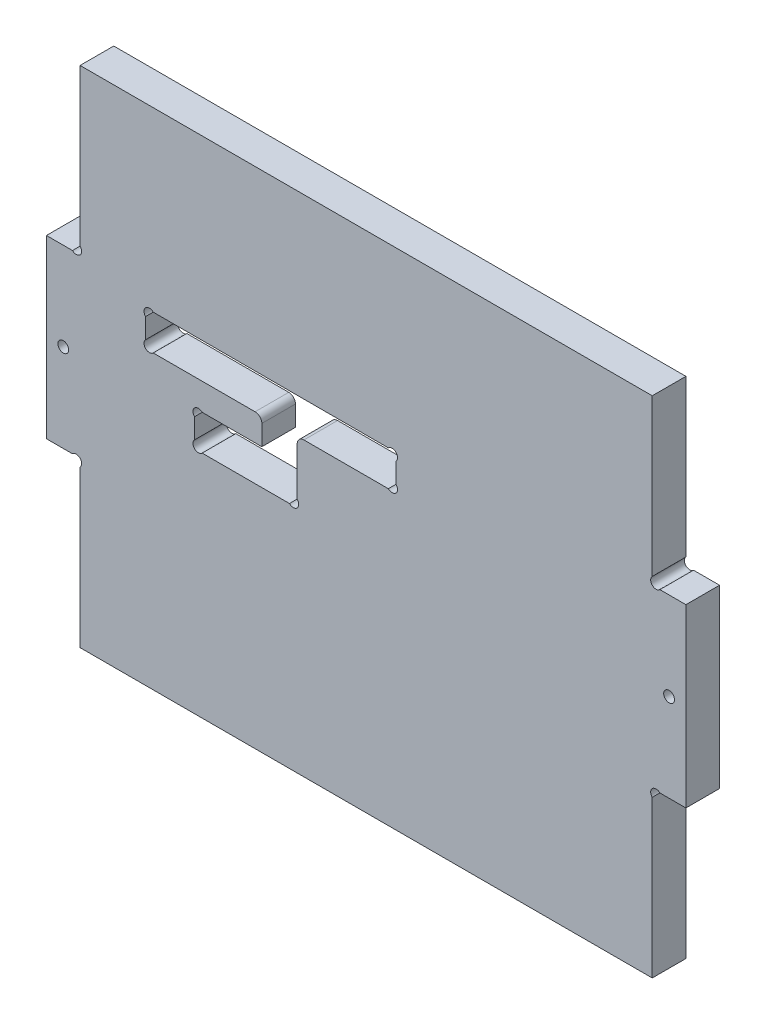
ISO-10303-21;
HEADER;
FILE_DESCRIPTION(('STEP AP214'),'2;1');
FILE_NAME('part.step','',(''),(''),'','','');
FILE_SCHEMA(('AUTOMOTIVE_DESIGN { 1 0 10303 214 1 1 1 1 }'));
ENDSEC;
DATA;
#1=APPLICATION_CONTEXT('core data for automotive mechanical design processes');
#2=APPLICATION_PROTOCOL_DEFINITION('international standard','automotive_design',2000,#1);
#3=PRODUCT_CONTEXT('',#1,'mechanical');
#4=PRODUCT('Part','Part','',(#3));
#5=PRODUCT_RELATED_PRODUCT_CATEGORY('part','',(#4));
#6=PRODUCT_DEFINITION_FORMATION('','',#4);
#7=PRODUCT_DEFINITION_CONTEXT('part definition',#1,'design');
#8=PRODUCT_DEFINITION('design','',#6,#7);
#9=PRODUCT_DEFINITION_SHAPE('','',#8);
#10=(LENGTH_UNIT() NAMED_UNIT(*) SI_UNIT(.MILLI.,.METRE.));
#11=(NAMED_UNIT(*) PLANE_ANGLE_UNIT() SI_UNIT($,.RADIAN.));
#12=(NAMED_UNIT(*) SI_UNIT($,.STERADIAN.) SOLID_ANGLE_UNIT());
#13=UNCERTAINTY_MEASURE_WITH_UNIT(LENGTH_MEASURE(1.E-05),#10,'distance_accuracy_value','');
#14=(GEOMETRIC_REPRESENTATION_CONTEXT(3) GLOBAL_UNCERTAINTY_ASSIGNED_CONTEXT((#13)) GLOBAL_UNIT_ASSIGNED_CONTEXT((#10,
#11,#12)) REPRESENTATION_CONTEXT('',''));
#15=CARTESIAN_POINT('',(0.,0.,0.));
#16=DIRECTION('',(0.,0.,1.));
#17=DIRECTION('',(1.,0.,0.));
#18=AXIS2_PLACEMENT_3D('',#15,#16,#17);
#19=CARTESIAN_POINT('',(0.,0.,10.));
#20=DIRECTION('',(0.,0.,1.));
#21=DIRECTION('',(1.,0.,0.));
#22=AXIS2_PLACEMENT_3D('',#19,#20,#21);
#23=PLANE('',#22);
#24=CARTESIAN_POINT('',(-90.,-23.0014404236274,10.));
#25=DIRECTION('',(0.,0.,-1.));
#26=DIRECTION('',(1.,0.,0.));
#27=AXIS2_PLACEMENT_3D('',#24,#25,#26);
#28=CIRCLE('',#27,1.60000000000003);
#29=CARTESIAN_POINT('',(-88.4,-23.0014404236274,10.));
#30=VERTEX_POINT('',#29);
#31=EDGE_CURVE('E381',#30,#30,#28,.T.);
#32=ORIENTED_EDGE('',*,*,#31,.T.);
#33=EDGE_LOOP('',(#32));
#34=FACE_BOUND('',#33,.T.);
#35=CARTESIAN_POINT('',(90.,-23.0014404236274,10.));
#36=DIRECTION('',(0.,0.,-1.));
#37=DIRECTION('',(-1.,0.,0.));
#38=AXIS2_PLACEMENT_3D('',#35,#36,#37);
#39=CIRCLE('',#38,1.6);
#40=CARTESIAN_POINT('',(88.4,-23.0014404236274,10.));
#41=VERTEX_POINT('',#40);
#42=EDGE_CURVE('E387',#41,#41,#39,.T.);
#43=ORIENTED_EDGE('',*,*,#42,.T.);
#44=EDGE_LOOP('',(#43));
#45=FACE_BOUND('',#44,.T.);
#46=DIRECTION('',(1.,0.,0.));
#47=VECTOR('',#46,1.);
#48=CARTESIAN_POINT('',(-20.5000000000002,-11.2114404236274,10.));
#49=LINE('',#48,#47);
#50=CARTESIAN_POINT('',(-18.5000000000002,-11.2114404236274,10.));
#51=VERTEX_POINT('',#50);
#52=CARTESIAN_POINT('',(6.5832987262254,-11.2114404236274,10.));
#53=VERTEX_POINT('',#52);
#54=EDGE_CURVE('E420',#51,#53,#49,.T.);
#55=ORIENTED_EDGE('',*,*,#54,.F.);
#56=CARTESIAN_POINT('',(-18.5000000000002,-13.2114404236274,10.));
#57=DIRECTION('',(0.,0.,1.));
#58=DIRECTION('',(1.,0.,0.));
#59=AXIS2_PLACEMENT_3D('',#56,#57,#58);
#60=CIRCLE('',#59,2.);
#61=CARTESIAN_POINT('',(-20.5000000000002,-13.2114404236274,10.));
#62=VERTEX_POINT('',#61);
#63=EDGE_CURVE('E651',#51,#62,#60,.T.);
#64=ORIENTED_EDGE('',*,*,#63,.T.);
#65=DIRECTION('',(0.,1.,0.));
#66=VECTOR('',#65,1.);
#67=CARTESIAN_POINT('',(-20.5000000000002,-0.71144042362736,10.));
#68=LINE('',#67,#66);
#69=CARTESIAN_POINT('',(-20.5000000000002,-27.478767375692,10.));
#70=VERTEX_POINT('',#69);
#71=EDGE_CURVE('E606',#70,#62,#68,.T.);
#72=ORIENTED_EDGE('',*,*,#71,.F.);
#73=CARTESIAN_POINT('',(-21.6462079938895,-28.5951038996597,10.));
#74=DIRECTION('',(0.,0.,1.));
#75=DIRECTION('',(1.,0.,0.));
#76=AXIS2_PLACEMENT_3D('',#73,#74,#75);
#77=CIRCLE('',#76,1.59999999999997);
#78=CARTESIAN_POINT('',(-22.7924159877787,-29.7114404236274,10.));
#79=VERTEX_POINT('',#78);
#80=EDGE_CURVE('E604',#79,#70,#77,.T.);
#81=ORIENTED_EDGE('',*,*,#80,.F.);
#82=DIRECTION('',(1.,0.,0.));
#83=VECTOR('',#82,1.);
#84=CARTESIAN_POINT('',(-31.0000000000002,-29.7114404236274,10.));
#85=LINE('',#84,#83);
#86=CARTESIAN_POINT('',(-48.739460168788,-29.7114404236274,10.));
#87=VERTEX_POINT('',#86);
#88=EDGE_CURVE('E601',#87,#79,#85,.T.);
#89=ORIENTED_EDGE('',*,*,#88,.F.);
#90=CARTESIAN_POINT('',(-49.8697300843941,-28.5789697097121,10.));
#91=DIRECTION('',(0.,0.,1.));
#92=DIRECTION('',(1.,0.,0.));
#93=AXIS2_PLACEMENT_3D('',#90,#91,#92);
#94=CIRCLE('',#93,1.6);
#95=CARTESIAN_POINT('',(-51.0000000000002,-27.4464989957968,10.));
#96=VERTEX_POINT('',#95);
#97=EDGE_CURVE('E397',#96,#87,#94,.T.);
#98=ORIENTED_EDGE('',*,*,#97,.F.);
#99=DIRECTION('',(0.,-1.,0.));
#100=VECTOR('',#99,1.);
#101=CARTESIAN_POINT('',(-51.0000000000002,-27.4464989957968,10.));
#102=LINE('',#101,#100);
#103=CARTESIAN_POINT('',(-51.0000000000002,-21.4763818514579,10.));
#104=VERTEX_POINT('',#103);
#105=EDGE_CURVE('E412',#104,#96,#102,.T.);
#106=ORIENTED_EDGE('',*,*,#105,.F.);
#107=CARTESIAN_POINT('',(-49.8697300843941,-20.3439111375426,10.));
#108=DIRECTION('',(0.,0.,1.));
#109=DIRECTION('',(-1.,0.,0.));
#110=AXIS2_PLACEMENT_3D('',#107,#108,#109);
#111=CIRCLE('',#110,1.6);
#112=CARTESIAN_POINT('',(-48.739460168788,-19.2114404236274,10.));
#113=VERTEX_POINT('',#112);
#114=EDGE_CURVE('E409',#113,#104,#111,.T.);
#115=ORIENTED_EDGE('',*,*,#114,.F.);
#116=DIRECTION('',(-1.,0.,0.));
#117=VECTOR('',#116,1.);
#118=CARTESIAN_POINT('',(-31.0000000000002,-19.2114404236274,10.));
#119=LINE('',#118,#117);
#120=CARTESIAN_POINT('',(-31.0000000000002,-19.2114404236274,10.));
#121=VERTEX_POINT('',#120);
#122=EDGE_CURVE('E390',#121,#113,#119,.T.);
#123=ORIENTED_EDGE('',*,*,#122,.F.);
#124=DIRECTION('',(0.,-1.,0.));
#125=VECTOR('',#124,1.);
#126=CARTESIAN_POINT('',(-31.0000000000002,-0.71144042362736,10.));
#127=LINE('',#126,#125);
#128=CARTESIAN_POINT('',(-31.0000000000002,-13.2114404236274,10.));
#129=VERTEX_POINT('',#128);
#130=EDGE_CURVE('E599',#129,#121,#127,.T.);
#131=ORIENTED_EDGE('',*,*,#130,.F.);
#132=CARTESIAN_POINT('',(-33.0000000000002,-13.2114404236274,10.));
#133=DIRECTION('',(0.,0.,1.));
#134=DIRECTION('',(1.,0.,0.));
#135=AXIS2_PLACEMENT_3D('',#132,#133,#134);
#136=CIRCLE('',#135,2.);
#137=CARTESIAN_POINT('',(-33.0000000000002,-11.2114404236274,10.));
#138=VERTEX_POINT('',#137);
#139=EDGE_CURVE('E649',#129,#138,#136,.T.);
#140=ORIENTED_EDGE('',*,*,#139,.T.);
#141=DIRECTION('',(1.,0.,0.));
#142=VECTOR('',#141,1.);
#143=CARTESIAN_POINT('',(-31.0000000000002,-11.2114404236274,10.));
#144=LINE('',#143,#142);
#145=CARTESIAN_POINT('',(-63.2772583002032,-11.2114404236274,10.));
#146=VERTEX_POINT('',#145);
#147=EDGE_CURVE('E465',#146,#138,#144,.T.);
#148=ORIENTED_EDGE('',*,*,#147,.F.);
#149=CARTESIAN_POINT('',(-64.4086291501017,-10.0800695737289,10.));
#150=DIRECTION('',(0.,0.,1.));
#151=DIRECTION('',(1.,0.,0.));
#152=AXIS2_PLACEMENT_3D('',#149,#150,#151);
#153=CIRCLE('',#152,1.6);
#154=CARTESIAN_POINT('',(-65.5400000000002,-8.94869872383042,10.));
#155=VERTEX_POINT('',#154);
#156=EDGE_CURVE('E479',#155,#146,#153,.T.);
#157=ORIENTED_EDGE('',*,*,#156,.F.);
#158=DIRECTION('',(0.,-1.,0.));
#159=VECTOR('',#158,1.);
#160=CARTESIAN_POINT('',(-65.5400000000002,-2.97418212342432,10.));
#161=LINE('',#160,#159);
#162=CARTESIAN_POINT('',(-65.5400000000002,-2.97418212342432,10.));
#163=VERTEX_POINT('',#162);
#164=EDGE_CURVE('E476',#163,#155,#161,.T.);
#165=ORIENTED_EDGE('',*,*,#164,.F.);
#166=CARTESIAN_POINT('',(-64.4086291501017,-1.84281127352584,10.));
#167=DIRECTION('',(0.,0.,1.));
#168=DIRECTION('',(1.,0.,0.));
#169=AXIS2_PLACEMENT_3D('',#166,#167,#168);
#170=CIRCLE('',#169,1.6);
#171=CARTESIAN_POINT('',(-63.2772583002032,-0.711440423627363,10.));
#172=VERTEX_POINT('',#171);
#173=EDGE_CURVE('E454',#172,#163,#170,.T.);
#174=ORIENTED_EDGE('',*,*,#173,.F.);
#175=DIRECTION('',(-1.,0.,0.));
#176=VECTOR('',#175,1.);
#177=CARTESIAN_POINT('',(-31.0000000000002,-0.71144042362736,10.));
#178=LINE('',#177,#176);
#179=CARTESIAN_POINT('',(6.5832987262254,-0.711440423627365,10.));
#180=VERTEX_POINT('',#179);
#181=EDGE_CURVE('E609',#180,#172,#178,.T.);
#182=ORIENTED_EDGE('',*,*,#181,.F.);
#183=CARTESIAN_POINT('',(7.71164936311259,-1.84582344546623,10.));
#184=DIRECTION('',(0.,0.,1.));
#185=DIRECTION('',(1.,0.,0.));
#186=AXIS2_PLACEMENT_3D('',#183,#184,#185);
#187=CIRCLE('',#186,1.6);
#188=CARTESIAN_POINT('',(8.83999999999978,-2.9802064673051,10.));
#189=VERTEX_POINT('',#188);
#190=EDGE_CURVE('E432',#189,#180,#187,.T.);
#191=ORIENTED_EDGE('',*,*,#190,.F.);
#192=DIRECTION('',(0.,1.,0.));
#193=VECTOR('',#192,1.);
#194=CARTESIAN_POINT('',(8.83999999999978,-2.9802064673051,10.));
#195=LINE('',#194,#193);
#196=CARTESIAN_POINT('',(8.83999999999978,-8.94267437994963,10.));
#197=VERTEX_POINT('',#196);
#198=EDGE_CURVE('E446',#197,#189,#195,.T.);
#199=ORIENTED_EDGE('',*,*,#198,.F.);
#200=CARTESIAN_POINT('',(7.71164936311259,-10.0770574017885,10.));
#201=DIRECTION('',(0.,0.,1.));
#202=DIRECTION('',(-1.,0.,0.));
#203=AXIS2_PLACEMENT_3D('',#200,#201,#202);
#204=CIRCLE('',#203,1.6);
#205=EDGE_CURVE('E443',#53,#197,#204,.T.);
#206=ORIENTED_EDGE('',*,*,#205,.F.);
#207=EDGE_LOOP('',(#55,#64,#72,#81,#89,#98,#106,#115,#123,#131,#140,#148,#157,#165,#174,#182,
#191,#199,#206));
#208=FACE_BOUND('',#207,.T.);
#209=DIRECTION('',(-1.,0.,0.));
#210=VECTOR('',#209,1.);
#211=CARTESIAN_POINT('',(95.,-49.1614404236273,10.));
#212=LINE('',#211,#210);
#213=CARTESIAN_POINT('',(95.,-49.1614404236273,10.));
#214=VERTEX_POINT('',#213);
#215=CARTESIAN_POINT('',(87.262741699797,-49.1614404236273,10.));
#216=VERTEX_POINT('',#215);
#217=EDGE_CURVE('E497',#214,#216,#212,.T.);
#218=ORIENTED_EDGE('',*,*,#217,.F.);
#219=DIRECTION('',(0.,1.,0.));
#220=VECTOR('',#219,1.);
#221=CARTESIAN_POINT('',(94.9999999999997,41.9079201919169,10.));
#222=LINE('',#221,#220);
#223=CARTESIAN_POINT('',(95.,3.15792019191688,10.));
#224=VERTEX_POINT('',#223);
#225=EDGE_CURVE('E627',#214,#224,#222,.T.);
#226=ORIENTED_EDGE('',*,*,#225,.T.);
#227=DIRECTION('',(1.,0.,0.));
#228=VECTOR('',#227,1.);
#229=CARTESIAN_POINT('',(95.,3.15792019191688,10.));
#230=LINE('',#229,#228);
#231=CARTESIAN_POINT('',(87.262741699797,3.15792019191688,10.));
#232=VERTEX_POINT('',#231);
#233=EDGE_CURVE('E558',#232,#224,#230,.T.);
#234=ORIENTED_EDGE('',*,*,#233,.F.);
#235=CARTESIAN_POINT('',(86.1313708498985,4.28929104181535,10.));
#236=DIRECTION('',(0.,0.,1.));
#237=DIRECTION('',(1.,0.,0.));
#238=AXIS2_PLACEMENT_3D('',#235,#236,#237);
#239=CIRCLE('',#238,1.6);
#240=CARTESIAN_POINT('',(85.,5.42066189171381,10.));
#241=VERTEX_POINT('',#240);
#242=EDGE_CURVE('E538',#241,#232,#239,.T.);
#243=ORIENTED_EDGE('',*,*,#242,.F.);
#244=DIRECTION('',(0.,-1.,0.));
#245=VECTOR('',#244,1.);
#246=CARTESIAN_POINT('',(85.,51.9079201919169,10.));
#247=LINE('',#246,#245);
#248=CARTESIAN_POINT('',(85.,51.9079201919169,10.));
#249=VERTEX_POINT('',#248);
#250=EDGE_CURVE('E549',#249,#241,#247,.T.);
#251=ORIENTED_EDGE('',*,*,#250,.F.);
#252=DIRECTION('',(-1.,0.,0.));
#253=VECTOR('',#252,1.);
#254=CARTESIAN_POINT('',(94.9999999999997,51.9079201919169,10.));
#255=LINE('',#254,#253);
#256=CARTESIAN_POINT('',(-85.,51.9079201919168,10.));
#257=VERTEX_POINT('',#256);
#258=EDGE_CURVE('E629',#249,#257,#255,.T.);
#259=ORIENTED_EDGE('',*,*,#258,.T.);
#260=DIRECTION('',(0.,1.,0.));
#261=VECTOR('',#260,1.);
#262=CARTESIAN_POINT('',(-85.,51.9079201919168,10.));
#263=LINE('',#262,#261);
#264=CARTESIAN_POINT('',(-85.,5.42066189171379,10.));
#265=VERTEX_POINT('',#264);
#266=EDGE_CURVE('E532',#265,#257,#263,.T.);
#267=ORIENTED_EDGE('',*,*,#266,.F.);
#268=CARTESIAN_POINT('',(-86.1313708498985,4.28929104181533,10.));
#269=DIRECTION('',(0.,0.,1.));
#270=DIRECTION('',(-1.,0.,0.));
#271=AXIS2_PLACEMENT_3D('',#268,#269,#270);
#272=CIRCLE('',#271,1.6);
#273=CARTESIAN_POINT('',(-87.2627416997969,3.15792019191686,10.));
#274=VERTEX_POINT('',#273);
#275=EDGE_CURVE('E512',#274,#265,#272,.T.);
#276=ORIENTED_EDGE('',*,*,#275,.F.);
#277=DIRECTION('',(1.,0.,0.));
#278=VECTOR('',#277,1.);
#279=CARTESIAN_POINT('',(-95.,3.15792019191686,10.));
#280=LINE('',#279,#278);
#281=CARTESIAN_POINT('',(-95.,3.15792019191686,10.));
#282=VERTEX_POINT('',#281);
#283=EDGE_CURVE('E523',#282,#274,#280,.T.);
#284=ORIENTED_EDGE('',*,*,#283,.F.);
#285=DIRECTION('',(0.,-1.,0.));
#286=VECTOR('',#285,1.);
#287=CARTESIAN_POINT('',(-95.0000000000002,41.9079201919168,10.));
#288=LINE('',#287,#286);
#289=CARTESIAN_POINT('',(-95.,-49.1614404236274,10.));
#290=VERTEX_POINT('',#289);
#291=EDGE_CURVE('E633',#282,#290,#288,.T.);
#292=ORIENTED_EDGE('',*,*,#291,.T.);
#293=DIRECTION('',(-1.,0.,0.));
#294=VECTOR('',#293,1.);
#295=CARTESIAN_POINT('',(-95.,-49.1614404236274,10.));
#296=LINE('',#295,#294);
#297=CARTESIAN_POINT('',(-87.2627416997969,-49.1614404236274,10.));
#298=VERTEX_POINT('',#297);
#299=EDGE_CURVE('E585',#298,#290,#296,.T.);
#300=ORIENTED_EDGE('',*,*,#299,.F.);
#301=CARTESIAN_POINT('',(-86.1313708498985,-50.2928112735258,10.));
#302=DIRECTION('',(0.,0.,1.));
#303=DIRECTION('',(1.,0.,0.));
#304=AXIS2_PLACEMENT_3D('',#301,#302,#303);
#305=CIRCLE('',#304,1.6);
#306=CARTESIAN_POINT('',(-85.,-51.4241821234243,10.));
#307=VERTEX_POINT('',#306);
#308=EDGE_CURVE('E565',#307,#298,#305,.T.);
#309=ORIENTED_EDGE('',*,*,#308,.F.);
#310=DIRECTION('',(0.,1.,0.));
#311=VECTOR('',#310,1.);
#312=CARTESIAN_POINT('',(-84.9999999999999,-97.9114404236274,10.));
#313=LINE('',#312,#311);
#314=CARTESIAN_POINT('',(-84.9999999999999,-97.9114404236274,10.));
#315=VERTEX_POINT('',#314);
#316=EDGE_CURVE('E576',#315,#307,#313,.T.);
#317=ORIENTED_EDGE('',*,*,#316,.F.);
#318=DIRECTION('',(1.,0.,0.));
#319=VECTOR('',#318,1.);
#320=CARTESIAN_POINT('',(-95.0000000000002,-97.9114404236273,10.));
#321=LINE('',#320,#319);
#322=CARTESIAN_POINT('',(85.,-97.9114404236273,10.));
#323=VERTEX_POINT('',#322);
#324=EDGE_CURVE('E635',#315,#323,#321,.T.);
#325=ORIENTED_EDGE('',*,*,#324,.T.);
#326=DIRECTION('',(0.,-1.,0.));
#327=VECTOR('',#326,1.);
#328=CARTESIAN_POINT('',(85.,-97.9114404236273,10.));
#329=LINE('',#328,#327);
#330=CARTESIAN_POINT('',(85.,-51.4241821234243,10.));
#331=VERTEX_POINT('',#330);
#332=EDGE_CURVE('E506',#331,#323,#329,.T.);
#333=ORIENTED_EDGE('',*,*,#332,.F.);
#334=CARTESIAN_POINT('',(86.1313708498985,-50.2928112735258,10.));
#335=DIRECTION('',(0.,0.,1.));
#336=DIRECTION('',(-1.,0.,0.));
#337=AXIS2_PLACEMENT_3D('',#334,#335,#336);
#338=CIRCLE('',#337,1.6);
#339=EDGE_CURVE('E486',#216,#331,#338,.T.);
#340=ORIENTED_EDGE('',*,*,#339,.F.);
#341=EDGE_LOOP('',(#218,#226,#234,#243,#251,#259,#267,#276,#284,#292,#300,#309,#317,#325,#333,#340));
#342=FACE_BOUND('',#341,.T.);
#343=ADVANCED_FACE('F35',(#34,#45,#208,#342),#23,.T.);
#344=CARTESIAN_POINT('',(0.,0.,0.));
#345=DIRECTION('',(0.,0.,1.));
#346=DIRECTION('',(1.,0.,0.));
#347=AXIS2_PLACEMENT_3D('',#344,#345,#346);
#348=PLANE('',#347);
#349=DIRECTION('',(0.,-1.,0.));
#350=VECTOR('',#349,1.);
#351=CARTESIAN_POINT('',(-0.999992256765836,-68.990367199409,0.));
#352=LINE('',#351,#350);
#353=CARTESIAN_POINT('',(-0.999992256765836,-68.990367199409,0.));
#354=VERTEX_POINT('',#353);
#355=CARTESIAN_POINT('',(-0.999992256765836,-90.6514815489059,0.));
#356=VERTEX_POINT('',#355);
#357=EDGE_CURVE('E351',#354,#356,#352,.T.);
#358=ORIENTED_EDGE('',*,*,#357,.F.);
#359=CARTESIAN_POINT('',(-2.13222712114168,-67.8598610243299,0.));
#360=DIRECTION('',(0.,0.,-1.));
#361=DIRECTION('',(-1.,0.,0.));
#362=AXIS2_PLACEMENT_3D('',#359,#360,#361);
#363=CIRCLE('',#362,1.6);
#364=CARTESIAN_POINT('',(-3.26446198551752,-66.7293548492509,0.));
#365=VERTEX_POINT('',#364);
#366=EDGE_CURVE('E50',#365,#354,#363,.T.);
#367=ORIENTED_EDGE('',*,*,#366,.F.);
#368=DIRECTION('',(1.,0.,0.));
#369=VECTOR('',#368,1.);
#370=CARTESIAN_POINT('',(-3.26446198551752,-66.7293548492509,0.));
#371=LINE('',#370,#369);
#372=CARTESIAN_POINT('',(-8.73643595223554,-66.7293548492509,0.));
#373=VERTEX_POINT('',#372);
#374=EDGE_CURVE('E331',#373,#365,#371,.T.);
#375=ORIENTED_EDGE('',*,*,#374,.F.);
#376=CARTESIAN_POINT('',(-9.86867081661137,-67.8598610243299,0.));
#377=DIRECTION('',(0.,0.,-1.));
#378=DIRECTION('',(1.,0.,0.));
#379=AXIS2_PLACEMENT_3D('',#376,#377,#378);
#380=CIRCLE('',#379,1.6);
#381=CARTESIAN_POINT('',(-11.0009056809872,-68.990367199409,0.));
#382=VERTEX_POINT('',#381);
#383=EDGE_CURVE('E334',#382,#373,#380,.T.);
#384=ORIENTED_EDGE('',*,*,#383,.F.);
#385=DIRECTION('',(0.,1.,0.));
#386=VECTOR('',#385,1.);
#387=CARTESIAN_POINT('',(-11.0009056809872,-68.990367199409,0.));
#388=LINE('',#387,#386);
#389=CARTESIAN_POINT('',(-11.0009056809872,-90.6514815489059,0.));
#390=VERTEX_POINT('',#389);
#391=EDGE_CURVE('E362',#390,#382,#388,.T.);
#392=ORIENTED_EDGE('',*,*,#391,.F.);
#393=CARTESIAN_POINT('',(-9.86867081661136,-91.781987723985,0.));
#394=DIRECTION('',(0.,0.,-1.));
#395=DIRECTION('',(-1.,0.,0.));
#396=AXIS2_PLACEMENT_3D('',#393,#394,#395);
#397=CIRCLE('',#396,1.6);
#398=CARTESIAN_POINT('',(-8.73643595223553,-92.912493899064,0.));
#399=VERTEX_POINT('',#398);
#400=EDGE_CURVE('E359',#399,#390,#397,.T.);
#401=ORIENTED_EDGE('',*,*,#400,.F.);
#402=DIRECTION('',(-1.,0.,0.));
#403=VECTOR('',#402,1.);
#404=CARTESIAN_POINT('',(-3.26446198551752,-92.912493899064,0.));
#405=LINE('',#404,#403);
#406=CARTESIAN_POINT('',(-3.26446198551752,-92.912493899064,0.));
#407=VERTEX_POINT('',#406);
#408=EDGE_CURVE('E356',#407,#399,#405,.T.);
#409=ORIENTED_EDGE('',*,*,#408,.F.);
#410=CARTESIAN_POINT('',(-2.13222712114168,-91.781987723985,0.));
#411=DIRECTION('',(0.,0.,-1.));
#412=DIRECTION('',(1.,0.,0.));
#413=AXIS2_PLACEMENT_3D('',#410,#411,#412);
#414=CIRCLE('',#413,1.6);
#415=EDGE_CURVE('E353',#356,#407,#414,.T.);
#416=ORIENTED_EDGE('',*,*,#415,.F.);
#417=EDGE_LOOP('',(#358,#367,#375,#384,#392,#401,#409,#416));
#418=FACE_BOUND('',#417,.T.);
#419=CARTESIAN_POINT('',(-90.,-23.0014404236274,0.));
#420=DIRECTION('',(0.,0.,-1.));
#421=DIRECTION('',(1.,0.,0.));
#422=AXIS2_PLACEMENT_3D('',#419,#420,#421);
#423=CIRCLE('',#422,1.60000000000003);
#424=CARTESIAN_POINT('',(-88.4,-23.0014404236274,0.));
#425=VERTEX_POINT('',#424);
#426=EDGE_CURVE('E369',#425,#425,#423,.T.);
#427=ORIENTED_EDGE('',*,*,#426,.F.);
#428=EDGE_LOOP('',(#427));
#429=FACE_BOUND('',#428,.T.);
#430=CARTESIAN_POINT('',(90.,-23.0014404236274,0.));
#431=DIRECTION('',(0.,0.,-1.));
#432=DIRECTION('',(-1.,0.,0.));
#433=AXIS2_PLACEMENT_3D('',#430,#431,#432);
#434=CIRCLE('',#433,1.6);
#435=CARTESIAN_POINT('',(88.4,-23.0014404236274,0.));
#436=VERTEX_POINT('',#435);
#437=EDGE_CURVE('E384',#436,#436,#434,.T.);
#438=ORIENTED_EDGE('',*,*,#437,.F.);
#439=EDGE_LOOP('',(#438));
#440=FACE_BOUND('',#439,.T.);
#441=DIRECTION('',(0.,1.,0.));
#442=VECTOR('',#441,1.);
#443=CARTESIAN_POINT('',(94.9999999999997,41.9079201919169,0.));
#444=LINE('',#443,#442);
#445=CARTESIAN_POINT('',(95.,-49.1614404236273,0.));
#446=VERTEX_POINT('',#445);
#447=CARTESIAN_POINT('',(95.,3.15792019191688,0.));
#448=VERTEX_POINT('',#447);
#449=EDGE_CURVE('E626',#446,#448,#444,.T.);
#450=ORIENTED_EDGE('',*,*,#449,.F.);
#451=DIRECTION('',(-1.,0.,0.));
#452=VECTOR('',#451,1.);
#453=CARTESIAN_POINT('',(95.,-49.1614404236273,0.));
#454=LINE('',#453,#452);
#455=CARTESIAN_POINT('',(87.262741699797,-49.1614404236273,0.));
#456=VERTEX_POINT('',#455);
#457=EDGE_CURVE('E500',#446,#456,#454,.T.);
#458=ORIENTED_EDGE('',*,*,#457,.T.);
#459=CARTESIAN_POINT('',(86.1313708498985,-50.2928112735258,0.));
#460=DIRECTION('',(0.,0.,1.));
#461=DIRECTION('',(-1.,0.,0.));
#462=AXIS2_PLACEMENT_3D('',#459,#460,#461);
#463=CIRCLE('',#462,1.6);
#464=CARTESIAN_POINT('',(85.,-51.4241821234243,0.));
#465=VERTEX_POINT('',#464);
#466=EDGE_CURVE('E493',#456,#465,#463,.T.);
#467=ORIENTED_EDGE('',*,*,#466,.T.);
#468=DIRECTION('',(0.,-1.,0.));
#469=VECTOR('',#468,1.);
#470=CARTESIAN_POINT('',(85.,-97.9114404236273,0.));
#471=LINE('',#470,#469);
#472=CARTESIAN_POINT('',(85.,-97.9114404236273,0.));
#473=VERTEX_POINT('',#472);
#474=EDGE_CURVE('E496',#465,#473,#471,.T.);
#475=ORIENTED_EDGE('',*,*,#474,.T.);
#476=DIRECTION('',(1.,0.,0.));
#477=VECTOR('',#476,1.);
#478=CARTESIAN_POINT('',(-95.0000000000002,-97.9114404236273,0.));
#479=LINE('',#478,#477);
#480=CARTESIAN_POINT('',(-85.,-97.9114404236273,0.));
#481=VERTEX_POINT('',#480);
#482=EDGE_CURVE('E630',#481,#473,#479,.T.);
#483=ORIENTED_EDGE('',*,*,#482,.F.);
#484=DIRECTION('',(0.,1.,0.));
#485=VECTOR('',#484,1.);
#486=CARTESIAN_POINT('',(-84.9999999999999,-97.9114404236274,0.));
#487=LINE('',#486,#485);
#488=CARTESIAN_POINT('',(-85.,-51.4241821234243,0.));
#489=VERTEX_POINT('',#488);
#490=EDGE_CURVE('E579',#481,#489,#487,.T.);
#491=ORIENTED_EDGE('',*,*,#490,.T.);
#492=CARTESIAN_POINT('',(-86.1313708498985,-50.2928112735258,0.));
#493=DIRECTION('',(0.,0.,1.));
#494=DIRECTION('',(1.,0.,0.));
#495=AXIS2_PLACEMENT_3D('',#492,#493,#494);
#496=CIRCLE('',#495,1.6);
#497=CARTESIAN_POINT('',(-87.2627416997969,-49.1614404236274,0.));
#498=VERTEX_POINT('',#497);
#499=EDGE_CURVE('E572',#489,#498,#496,.T.);
#500=ORIENTED_EDGE('',*,*,#499,.T.);
#501=DIRECTION('',(-1.,0.,0.));
#502=VECTOR('',#501,1.);
#503=CARTESIAN_POINT('',(-95.,-49.1614404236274,0.));
#504=LINE('',#503,#502);
#505=CARTESIAN_POINT('',(-95.,-49.1614404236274,0.));
#506=VERTEX_POINT('',#505);
#507=EDGE_CURVE('E575',#498,#506,#504,.T.);
#508=ORIENTED_EDGE('',*,*,#507,.T.);
#509=DIRECTION('',(0.,-1.,0.));
#510=VECTOR('',#509,1.);
#511=CARTESIAN_POINT('',(-95.0000000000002,41.9079201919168,0.));
#512=LINE('',#511,#510);
#513=CARTESIAN_POINT('',(-95.0000000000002,3.15792019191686,0.));
#514=VERTEX_POINT('',#513);
#515=EDGE_CURVE('E643',#514,#506,#512,.T.);
#516=ORIENTED_EDGE('',*,*,#515,.F.);
#517=DIRECTION('',(1.,0.,0.));
#518=VECTOR('',#517,1.);
#519=CARTESIAN_POINT('',(-95.,3.15792019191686,0.));
#520=LINE('',#519,#518);
#521=CARTESIAN_POINT('',(-87.2627416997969,3.15792019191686,0.));
#522=VERTEX_POINT('',#521);
#523=EDGE_CURVE('E526',#514,#522,#520,.T.);
#524=ORIENTED_EDGE('',*,*,#523,.T.);
#525=CARTESIAN_POINT('',(-86.1313708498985,4.28929104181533,0.));
#526=DIRECTION('',(0.,0.,1.));
#527=DIRECTION('',(-1.,0.,0.));
#528=AXIS2_PLACEMENT_3D('',#525,#526,#527);
#529=CIRCLE('',#528,1.6);
#530=CARTESIAN_POINT('',(-85.,5.42066189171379,0.));
#531=VERTEX_POINT('',#530);
#532=EDGE_CURVE('E519',#522,#531,#529,.T.);
#533=ORIENTED_EDGE('',*,*,#532,.T.);
#534=DIRECTION('',(0.,1.,0.));
#535=VECTOR('',#534,1.);
#536=CARTESIAN_POINT('',(-85.,51.9079201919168,0.));
#537=LINE('',#536,#535);
#538=CARTESIAN_POINT('',(-85.,51.9079201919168,0.));
#539=VERTEX_POINT('',#538);
#540=EDGE_CURVE('E522',#531,#539,#537,.T.);
#541=ORIENTED_EDGE('',*,*,#540,.T.);
#542=DIRECTION('',(-1.,0.,0.));
#543=VECTOR('',#542,1.);
#544=CARTESIAN_POINT('',(94.9999999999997,51.9079201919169,0.));
#545=LINE('',#544,#543);
#546=CARTESIAN_POINT('',(85.,51.9079201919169,0.));
#547=VERTEX_POINT('',#546);
#548=EDGE_CURVE('E640',#547,#539,#545,.T.);
#549=ORIENTED_EDGE('',*,*,#548,.F.);
#550=DIRECTION('',(0.,-1.,0.));
#551=VECTOR('',#550,1.);
#552=CARTESIAN_POINT('',(85.,51.9079201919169,0.));
#553=LINE('',#552,#551);
#554=CARTESIAN_POINT('',(85.,5.42066189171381,0.));
#555=VERTEX_POINT('',#554);
#556=EDGE_CURVE('E552',#547,#555,#553,.T.);
#557=ORIENTED_EDGE('',*,*,#556,.T.);
#558=CARTESIAN_POINT('',(86.1313708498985,4.28929104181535,0.));
#559=DIRECTION('',(0.,0.,1.));
#560=DIRECTION('',(1.,0.,0.));
#561=AXIS2_PLACEMENT_3D('',#558,#559,#560);
#562=CIRCLE('',#561,1.6);
#563=CARTESIAN_POINT('',(87.262741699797,3.15792019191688,0.));
#564=VERTEX_POINT('',#563);
#565=EDGE_CURVE('E545',#555,#564,#562,.T.);
#566=ORIENTED_EDGE('',*,*,#565,.T.);
#567=DIRECTION('',(1.,0.,0.));
#568=VECTOR('',#567,1.);
#569=CARTESIAN_POINT('',(95.,3.15792019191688,0.));
#570=LINE('',#569,#568);
#571=EDGE_CURVE('E548',#564,#448,#570,.T.);
#572=ORIENTED_EDGE('',*,*,#571,.T.);
#573=EDGE_LOOP('',(#450,#458,#467,#475,#483,#491,#500,#508,#516,#524,#533,#541,#549,#557,#566,#572));
#574=FACE_BOUND('',#573,.T.);
#575=DIRECTION('',(0.,1.,0.));
#576=VECTOR('',#575,1.);
#577=CARTESIAN_POINT('',(-20.5000000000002,-0.71144042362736,0.));
#578=LINE('',#577,#576);
#579=CARTESIAN_POINT('',(-20.5000000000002,-27.478767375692,0.));
#580=VERTEX_POINT('',#579);
#581=CARTESIAN_POINT('',(-20.5000000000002,-13.2114404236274,0.));
#582=VERTEX_POINT('',#581);
#583=EDGE_CURVE('E619',#580,#582,#578,.T.);
#584=ORIENTED_EDGE('',*,*,#583,.T.);
#585=CARTESIAN_POINT('',(-18.5000000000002,-13.2114404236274,0.));
#586=DIRECTION('',(0.,0.,1.));
#587=DIRECTION('',(1.,0.,0.));
#588=AXIS2_PLACEMENT_3D('',#585,#586,#587);
#589=CIRCLE('',#588,2.);
#590=CARTESIAN_POINT('',(-18.5000000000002,-11.2114404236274,0.));
#591=VERTEX_POINT('',#590);
#592=EDGE_CURVE('E656',#582,#591,#589,.F.);
#593=ORIENTED_EDGE('',*,*,#592,.T.);
#594=DIRECTION('',(1.,0.,0.));
#595=VECTOR('',#594,1.);
#596=CARTESIAN_POINT('',(-20.5000000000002,-11.2114404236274,0.));
#597=LINE('',#596,#595);
#598=CARTESIAN_POINT('',(6.5832987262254,-11.2114404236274,0.));
#599=VERTEX_POINT('',#598);
#600=EDGE_CURVE('E429',#591,#599,#597,.T.);
#601=ORIENTED_EDGE('',*,*,#600,.T.);
#602=CARTESIAN_POINT('',(7.71164936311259,-10.0770574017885,0.));
#603=DIRECTION('',(0.,0.,1.));
#604=DIRECTION('',(-1.,0.,0.));
#605=AXIS2_PLACEMENT_3D('',#602,#603,#604);
#606=CIRCLE('',#605,1.6);
#607=CARTESIAN_POINT('',(8.83999999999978,-8.94267437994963,0.));
#608=VERTEX_POINT('',#607);
#609=EDGE_CURVE('E431',#599,#608,#606,.T.);
#610=ORIENTED_EDGE('',*,*,#609,.T.);
#611=DIRECTION('',(0.,1.,0.));
#612=VECTOR('',#611,1.);
#613=CARTESIAN_POINT('',(8.83999999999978,-2.9802064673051,0.));
#614=LINE('',#613,#612);
#615=CARTESIAN_POINT('',(8.83999999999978,-2.9802064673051,0.));
#616=VERTEX_POINT('',#615);
#617=EDGE_CURVE('E435',#608,#616,#614,.T.);
#618=ORIENTED_EDGE('',*,*,#617,.T.);
#619=CARTESIAN_POINT('',(7.71164936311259,-1.84582344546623,0.));
#620=DIRECTION('',(0.,0.,1.));
#621=DIRECTION('',(1.,0.,0.));
#622=AXIS2_PLACEMENT_3D('',#619,#620,#621);
#623=CIRCLE('',#622,1.6);
#624=CARTESIAN_POINT('',(6.5832987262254,-0.711440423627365,0.));
#625=VERTEX_POINT('',#624);
#626=EDGE_CURVE('E438',#616,#625,#623,.T.);
#627=ORIENTED_EDGE('',*,*,#626,.T.);
#628=DIRECTION('',(-1.,0.,0.));
#629=VECTOR('',#628,1.);
#630=CARTESIAN_POINT('',(-31.0000000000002,-0.71144042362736,0.));
#631=LINE('',#630,#629);
#632=CARTESIAN_POINT('',(-63.2772583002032,-0.711440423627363,0.));
#633=VERTEX_POINT('',#632);
#634=EDGE_CURVE('E602',#625,#633,#631,.T.);
#635=ORIENTED_EDGE('',*,*,#634,.T.);
#636=CARTESIAN_POINT('',(-64.4086291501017,-1.84281127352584,0.));
#637=DIRECTION('',(0.,0.,1.));
#638=DIRECTION('',(1.,0.,0.));
#639=AXIS2_PLACEMENT_3D('',#636,#637,#638);
#640=CIRCLE('',#639,1.6);
#641=CARTESIAN_POINT('',(-65.5400000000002,-2.97418212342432,0.));
#642=VERTEX_POINT('',#641);
#643=EDGE_CURVE('E461',#633,#642,#640,.T.);
#644=ORIENTED_EDGE('',*,*,#643,.T.);
#645=DIRECTION('',(0.,-1.,0.));
#646=VECTOR('',#645,1.);
#647=CARTESIAN_POINT('',(-65.5400000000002,-2.97418212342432,0.));
#648=LINE('',#647,#646);
#649=CARTESIAN_POINT('',(-65.5400000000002,-8.94869872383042,0.));
#650=VERTEX_POINT('',#649);
#651=EDGE_CURVE('E464',#642,#650,#648,.T.);
#652=ORIENTED_EDGE('',*,*,#651,.T.);
#653=CARTESIAN_POINT('',(-64.4086291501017,-10.0800695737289,0.));
#654=DIRECTION('',(0.,0.,1.));
#655=DIRECTION('',(1.,0.,0.));
#656=AXIS2_PLACEMENT_3D('',#653,#654,#655);
#657=CIRCLE('',#656,1.6);
#658=CARTESIAN_POINT('',(-63.2772583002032,-11.2114404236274,0.));
#659=VERTEX_POINT('',#658);
#660=EDGE_CURVE('E468',#650,#659,#657,.T.);
#661=ORIENTED_EDGE('',*,*,#660,.T.);
#662=DIRECTION('',(1.,0.,0.));
#663=VECTOR('',#662,1.);
#664=CARTESIAN_POINT('',(-58.2793043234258,-11.2114404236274,0.));
#665=LINE('',#664,#663);
#666=CARTESIAN_POINT('',(-33.0000000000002,-11.2114404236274,0.));
#667=VERTEX_POINT('',#666);
#668=EDGE_CURVE('E471',#659,#667,#665,.T.);
#669=ORIENTED_EDGE('',*,*,#668,.T.);
#670=CARTESIAN_POINT('',(-33.0000000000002,-13.2114404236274,0.));
#671=DIRECTION('',(0.,0.,1.));
#672=DIRECTION('',(1.,0.,0.));
#673=AXIS2_PLACEMENT_3D('',#670,#671,#672);
#674=CIRCLE('',#673,2.);
#675=CARTESIAN_POINT('',(-31.0000000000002,-13.2114404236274,0.));
#676=VERTEX_POINT('',#675);
#677=EDGE_CURVE('E58',#667,#676,#674,.F.);
#678=ORIENTED_EDGE('',*,*,#677,.T.);
#679=DIRECTION('',(0.,-1.,0.));
#680=VECTOR('',#679,1.);
#681=CARTESIAN_POINT('',(-31.0000000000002,-0.71144042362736,0.));
#682=LINE('',#681,#680);
#683=CARTESIAN_POINT('',(-31.0000000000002,-19.2114404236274,0.));
#684=VERTEX_POINT('',#683);
#685=EDGE_CURVE('E592',#676,#684,#682,.T.);
#686=ORIENTED_EDGE('',*,*,#685,.T.);
#687=DIRECTION('',(-1.,0.,0.));
#688=VECTOR('',#687,1.);
#689=CARTESIAN_POINT('',(-31.0000000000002,-19.2114404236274,0.));
#690=LINE('',#689,#688);
#691=CARTESIAN_POINT('',(-48.739460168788,-19.2114404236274,0.));
#692=VERTEX_POINT('',#691);
#693=EDGE_CURVE('E393',#684,#692,#690,.T.);
#694=ORIENTED_EDGE('',*,*,#693,.T.);
#695=CARTESIAN_POINT('',(-49.8697300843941,-20.3439111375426,0.));
#696=DIRECTION('',(0.,0.,1.));
#697=DIRECTION('',(-1.,0.,0.));
#698=AXIS2_PLACEMENT_3D('',#695,#696,#697);
#699=CIRCLE('',#698,1.6);
#700=CARTESIAN_POINT('',(-51.0000000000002,-21.4763818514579,0.));
#701=VERTEX_POINT('',#700);
#702=EDGE_CURVE('E396',#692,#701,#699,.T.);
#703=ORIENTED_EDGE('',*,*,#702,.T.);
#704=DIRECTION('',(0.,-1.,0.));
#705=VECTOR('',#704,1.);
#706=CARTESIAN_POINT('',(-51.0000000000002,-27.4464989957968,0.));
#707=LINE('',#706,#705);
#708=CARTESIAN_POINT('',(-51.0000000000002,-27.4464989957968,0.));
#709=VERTEX_POINT('',#708);
#710=EDGE_CURVE('E400',#701,#709,#707,.T.);
#711=ORIENTED_EDGE('',*,*,#710,.T.);
#712=CARTESIAN_POINT('',(-49.8697300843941,-28.5789697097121,0.));
#713=DIRECTION('',(0.,0.,1.));
#714=DIRECTION('',(1.,0.,0.));
#715=AXIS2_PLACEMENT_3D('',#712,#713,#714);
#716=CIRCLE('',#715,1.6);
#717=CARTESIAN_POINT('',(-48.739460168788,-29.7114404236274,0.));
#718=VERTEX_POINT('',#717);
#719=EDGE_CURVE('E403',#709,#718,#716,.T.);
#720=ORIENTED_EDGE('',*,*,#719,.T.);
#721=DIRECTION('',(1.,0.,0.));
#722=VECTOR('',#721,1.);
#723=CARTESIAN_POINT('',(-31.0000000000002,-29.7114404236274,0.));
#724=LINE('',#723,#722);
#725=CARTESIAN_POINT('',(-22.7924159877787,-29.7114404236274,0.));
#726=VERTEX_POINT('',#725);
#727=EDGE_CURVE('E613',#718,#726,#724,.T.);
#728=ORIENTED_EDGE('',*,*,#727,.T.);
#729=CARTESIAN_POINT('',(-21.6462079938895,-28.5951038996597,0.));
#730=DIRECTION('',(0.,0.,1.));
#731=DIRECTION('',(1.,0.,0.));
#732=AXIS2_PLACEMENT_3D('',#729,#730,#731);
#733=CIRCLE('',#732,1.59999999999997);
#734=EDGE_CURVE('E616',#726,#580,#733,.T.);
#735=ORIENTED_EDGE('',*,*,#734,.T.);
#736=EDGE_LOOP('',(#584,#593,#601,#610,#618,#627,#635,#644,#652,#661,#669,#678,#686,#694,#703,
#711,#720,#728,#735));
#737=FACE_BOUND('',#736,.T.);
#738=ADVANCED_FACE('F675',(#418,#429,#440,#574,#737),#348,.F.);
#739=CARTESIAN_POINT('',(94.9999999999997,41.9079201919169,10.));
#740=DIRECTION('',(-1.,0.,0.));
#741=DIRECTION('',(0.,0.,1.));
#742=AXIS2_PLACEMENT_3D('',#739,#740,#741);
#743=PLANE('',#742);
#744=ORIENTED_EDGE('',*,*,#225,.F.);
#745=DIRECTION('',(0.,0.,1.));
#746=VECTOR('',#745,1.);
#747=CARTESIAN_POINT('',(95.,-49.1614404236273,0.));
#748=LINE('',#747,#746);
#749=EDGE_CURVE('E513',#446,#214,#748,.T.);
#750=ORIENTED_EDGE('',*,*,#749,.F.);
#751=ORIENTED_EDGE('',*,*,#449,.T.);
#752=DIRECTION('',(0.,0.,1.));
#753=VECTOR('',#752,1.);
#754=CARTESIAN_POINT('',(95.,3.15792019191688,0.));
#755=LINE('',#754,#753);
#756=EDGE_CURVE('E568',#448,#224,#755,.T.);
#757=ORIENTED_EDGE('',*,*,#756,.T.);
#758=EDGE_LOOP('',(#744,#750,#751,#757));
#759=FACE_BOUND('',#758,.T.);
#760=ADVANCED_FACE('F757',(#759),#743,.F.);
#761=CARTESIAN_POINT('',(94.9999999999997,51.9079201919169,10.));
#762=DIRECTION('',(0.,-1.,0.));
#763=DIRECTION('',(0.,0.,-1.));
#764=AXIS2_PLACEMENT_3D('',#761,#762,#763);
#765=PLANE('',#764);
#766=ORIENTED_EDGE('',*,*,#548,.T.);
#767=DIRECTION('',(0.,0.,1.));
#768=VECTOR('',#767,1.);
#769=CARTESIAN_POINT('',(-85.,51.9079201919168,0.));
#770=LINE('',#769,#768);
#771=EDGE_CURVE('E541',#539,#257,#770,.T.);
#772=ORIENTED_EDGE('',*,*,#771,.T.);
#773=ORIENTED_EDGE('',*,*,#258,.F.);
#774=DIRECTION('',(0.,0.,1.));
#775=VECTOR('',#774,1.);
#776=CARTESIAN_POINT('',(85.,51.9079201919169,0.));
#777=LINE('',#776,#775);
#778=EDGE_CURVE('E566',#547,#249,#777,.T.);
#779=ORIENTED_EDGE('',*,*,#778,.F.);
#780=EDGE_LOOP('',(#766,#772,#773,#779));
#781=FACE_BOUND('',#780,.T.);
#782=ADVANCED_FACE('F771',(#781),#765,.F.);
#783=CARTESIAN_POINT('',(-95.0000000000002,41.9079201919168,10.));
#784=DIRECTION('',(1.,0.,0.));
#785=DIRECTION('',(0.,1.,0.));
#786=AXIS2_PLACEMENT_3D('',#783,#784,#785);
#787=PLANE('',#786);
#788=ORIENTED_EDGE('',*,*,#291,.F.);
#789=DIRECTION('',(0.,0.,1.));
#790=VECTOR('',#789,1.);
#791=CARTESIAN_POINT('',(-95.,3.15792019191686,0.));
#792=LINE('',#791,#790);
#793=EDGE_CURVE('E539',#514,#282,#792,.T.);
#794=ORIENTED_EDGE('',*,*,#793,.F.);
#795=ORIENTED_EDGE('',*,*,#515,.T.);
#796=DIRECTION('',(0.,0.,1.));
#797=VECTOR('',#796,1.);
#798=CARTESIAN_POINT('',(-95.,-49.1614404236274,0.));
#799=LINE('',#798,#797);
#800=EDGE_CURVE('E595',#506,#290,#799,.T.);
#801=ORIENTED_EDGE('',*,*,#800,.T.);
#802=EDGE_LOOP('',(#788,#794,#795,#801));
#803=FACE_BOUND('',#802,.T.);
#804=ADVANCED_FACE('F767',(#803),#787,.F.);
#805=CARTESIAN_POINT('',(-95.0000000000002,-97.9114404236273,10.));
#806=DIRECTION('',(0.,1.,0.));
#807=DIRECTION('',(0.,0.,1.));
#808=AXIS2_PLACEMENT_3D('',#805,#806,#807);
#809=PLANE('',#808);
#810=ORIENTED_EDGE('',*,*,#482,.T.);
#811=DIRECTION('',(0.,0.,1.));
#812=VECTOR('',#811,1.);
#813=CARTESIAN_POINT('',(85.,-97.9114404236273,0.));
#814=LINE('',#813,#812);
#815=EDGE_CURVE('E515',#473,#323,#814,.T.);
#816=ORIENTED_EDGE('',*,*,#815,.T.);
#817=ORIENTED_EDGE('',*,*,#324,.F.);
#818=DIRECTION('',(0.,0.,1.));
#819=VECTOR('',#818,1.);
#820=CARTESIAN_POINT('',(-84.9999999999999,-97.9114404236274,0.));
#821=LINE('',#820,#819);
#822=EDGE_CURVE('E593',#481,#315,#821,.T.);
#823=ORIENTED_EDGE('',*,*,#822,.F.);
#824=EDGE_LOOP('',(#810,#816,#817,#823));
#825=FACE_BOUND('',#824,.T.);
#826=ADVANCED_FACE('F764',(#825),#809,.F.);
#827=CARTESIAN_POINT('',(-31.0000000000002,-0.71144042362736,10.));
#828=DIRECTION('',(1.,0.,0.));
#829=DIRECTION('',(0.,0.,-1.));
#830=AXIS2_PLACEMENT_3D('',#827,#828,#829);
#831=PLANE('',#830);
#832=ORIENTED_EDGE('',*,*,#685,.F.);
#833=DIRECTION('',(0.,0.,1.));
#834=VECTOR('',#833,1.);
#835=CARTESIAN_POINT('',(-31.0000000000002,-13.2114404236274,10.));
#836=LINE('',#835,#834);
#837=EDGE_CURVE('E43',#676,#129,#836,.T.);
#838=ORIENTED_EDGE('',*,*,#837,.T.);
#839=ORIENTED_EDGE('',*,*,#130,.T.);
#840=DIRECTION('',(0.,0.,1.));
#841=VECTOR('',#840,1.);
#842=CARTESIAN_POINT('',(-31.0000000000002,-19.2114404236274,0.));
#843=LINE('',#842,#841);
#844=EDGE_CURVE('E406',#684,#121,#843,.T.);
#845=ORIENTED_EDGE('',*,*,#844,.F.);
#846=EDGE_LOOP('',(#832,#838,#839,#845));
#847=FACE_BOUND('',#846,.T.);
#848=ADVANCED_FACE('F661',(#847),#831,.T.);
#849=CARTESIAN_POINT('',(-31.0000000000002,-29.7114404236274,10.));
#850=DIRECTION('',(0.,1.,0.));
#851=DIRECTION('',(0.,0.,1.));
#852=AXIS2_PLACEMENT_3D('',#849,#850,#851);
#853=PLANE('',#852);
#854=ORIENTED_EDGE('',*,*,#727,.F.);
#855=DIRECTION('',(0.,0.,1.));
#856=VECTOR('',#855,1.);
#857=CARTESIAN_POINT('',(-48.739460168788,-29.7114404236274,0.));
#858=LINE('',#857,#856);
#859=EDGE_CURVE('E417',#718,#87,#858,.T.);
#860=ORIENTED_EDGE('',*,*,#859,.T.);
#861=ORIENTED_EDGE('',*,*,#88,.T.);
#862=DIRECTION('',(0.,0.,-1.));
#863=VECTOR('',#862,1.);
#864=CARTESIAN_POINT('',(-22.7924159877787,-29.7114404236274,10.));
#865=LINE('',#864,#863);
#866=EDGE_CURVE('E624',#79,#726,#865,.T.);
#867=ORIENTED_EDGE('',*,*,#866,.T.);
#868=EDGE_LOOP('',(#854,#860,#861,#867));
#869=FACE_BOUND('',#868,.T.);
#870=ADVANCED_FACE('F688',(#869),#853,.T.);
#871=CARTESIAN_POINT('',(-21.6462079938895,-28.5951038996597,10.));
#872=DIRECTION('',(0.,0.,-1.));
#873=DIRECTION('',(-1.,0.,0.));
#874=AXIS2_PLACEMENT_3D('',#871,#872,#873);
#875=CYLINDRICAL_SURFACE('',#874,1.59999999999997);
#876=ORIENTED_EDGE('',*,*,#734,.F.);
#877=ORIENTED_EDGE('',*,*,#866,.F.);
#878=ORIENTED_EDGE('',*,*,#80,.T.);
#879=DIRECTION('',(0.,0.,-1.));
#880=VECTOR('',#879,1.);
#881=CARTESIAN_POINT('',(-20.5000000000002,-27.478767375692,10.));
#882=LINE('',#881,#880);
#883=EDGE_CURVE('E611',#70,#580,#882,.T.);
#884=ORIENTED_EDGE('',*,*,#883,.T.);
#885=EDGE_LOOP('',(#876,#877,#878,#884));
#886=FACE_BOUND('',#885,.T.);
#887=ADVANCED_FACE('F692',(#886),#875,.F.);
#888=CARTESIAN_POINT('',(-20.5000000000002,-0.71144042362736,10.));
#889=DIRECTION('',(-1.,0.,0.));
#890=DIRECTION('',(0.,-1.,0.));
#891=AXIS2_PLACEMENT_3D('',#888,#889,#890);
#892=PLANE('',#891);
#893=ORIENTED_EDGE('',*,*,#71,.T.);
#894=DIRECTION('',(0.,0.,1.));
#895=VECTOR('',#894,1.);
#896=CARTESIAN_POINT('',(-20.5000000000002,-13.2114404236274,0.));
#897=LINE('',#896,#895);
#898=EDGE_CURVE('E653',#62,#582,#897,.F.);
#899=ORIENTED_EDGE('',*,*,#898,.T.);
#900=ORIENTED_EDGE('',*,*,#583,.F.);
#901=ORIENTED_EDGE('',*,*,#883,.F.);
#902=EDGE_LOOP('',(#893,#899,#900,#901));
#903=FACE_BOUND('',#902,.T.);
#904=ADVANCED_FACE('F697',(#903),#892,.T.);
#905=CARTESIAN_POINT('',(-31.0000000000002,-0.71144042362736,10.));
#906=DIRECTION('',(0.,-1.,0.));
#907=DIRECTION('',(0.,0.,-1.));
#908=AXIS2_PLACEMENT_3D('',#905,#906,#907);
#909=PLANE('',#908);
#910=ORIENTED_EDGE('',*,*,#634,.F.);
#911=DIRECTION('',(0.,0.,1.));
#912=VECTOR('',#911,1.);
#913=CARTESIAN_POINT('',(6.5832987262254,-0.711440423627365,0.));
#914=LINE('',#913,#912);
#915=EDGE_CURVE('E451',#625,#180,#914,.T.);
#916=ORIENTED_EDGE('',*,*,#915,.T.);
#917=ORIENTED_EDGE('',*,*,#181,.T.);
#918=DIRECTION('',(0.,0.,1.));
#919=VECTOR('',#918,1.);
#920=CARTESIAN_POINT('',(-63.2772583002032,-0.711440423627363,0.));
#921=LINE('',#920,#919);
#922=EDGE_CURVE('E473',#633,#172,#921,.T.);
#923=ORIENTED_EDGE('',*,*,#922,.F.);
#924=EDGE_LOOP('',(#910,#916,#917,#923));
#925=FACE_BOUND('',#924,.T.);
#926=ADVANCED_FACE('F721',(#925),#909,.T.);
#927=CARTESIAN_POINT('',(-86.1313708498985,-50.2928112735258,0.));
#928=DIRECTION('',(0.,0.,1.));
#929=DIRECTION('',(1.,0.,0.));
#930=AXIS2_PLACEMENT_3D('',#927,#928,#929);
#931=CYLINDRICAL_SURFACE('',#930,1.6);
#932=ORIENTED_EDGE('',*,*,#308,.T.);
#933=DIRECTION('',(0.,0.,1.));
#934=VECTOR('',#933,1.);
#935=CARTESIAN_POINT('',(-87.2627416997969,-49.1614404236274,0.));
#936=LINE('',#935,#934);
#937=EDGE_CURVE('E582',#498,#298,#936,.T.);
#938=ORIENTED_EDGE('',*,*,#937,.F.);
#939=ORIENTED_EDGE('',*,*,#499,.F.);
#940=DIRECTION('',(0.,0.,1.));
#941=VECTOR('',#940,1.);
#942=CARTESIAN_POINT('',(-85.,-51.4241821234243,0.));
#943=LINE('',#942,#941);
#944=EDGE_CURVE('E590',#489,#307,#943,.T.);
#945=ORIENTED_EDGE('',*,*,#944,.T.);
#946=EDGE_LOOP('',(#932,#938,#939,#945));
#947=FACE_BOUND('',#946,.T.);
#948=ADVANCED_FACE('F945',(#947),#931,.F.);
#949=CARTESIAN_POINT('',(-84.9999999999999,-97.9114404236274,0.));
#950=DIRECTION('',(1.,0.,0.));
#951=DIRECTION('',(0.,1.,0.));
#952=AXIS2_PLACEMENT_3D('',#949,#950,#951);
#953=PLANE('',#952);
#954=ORIENTED_EDGE('',*,*,#316,.T.);
#955=ORIENTED_EDGE('',*,*,#944,.F.);
#956=ORIENTED_EDGE('',*,*,#490,.F.);
#957=ORIENTED_EDGE('',*,*,#822,.T.);
#958=EDGE_LOOP('',(#954,#955,#956,#957));
#959=FACE_BOUND('',#958,.T.);
#960=ADVANCED_FACE('F953',(#959),#953,.F.);
#961=CARTESIAN_POINT('',(-95.,-49.1614404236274,0.));
#962=DIRECTION('',(0.,1.,0.));
#963=DIRECTION('',(-1.,0.,0.));
#964=AXIS2_PLACEMENT_3D('',#961,#962,#963);
#965=PLANE('',#964);
#966=ORIENTED_EDGE('',*,*,#299,.T.);
#967=ORIENTED_EDGE('',*,*,#800,.F.);
#968=ORIENTED_EDGE('',*,*,#507,.F.);
#969=ORIENTED_EDGE('',*,*,#937,.T.);
#970=EDGE_LOOP('',(#966,#967,#968,#969));
#971=FACE_BOUND('',#970,.T.);
#972=ADVANCED_FACE('F961',(#971),#965,.F.);
#973=CARTESIAN_POINT('',(86.1313708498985,4.28929104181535,0.));
#974=DIRECTION('',(0.,0.,1.));
#975=DIRECTION('',(1.,0.,0.));
#976=AXIS2_PLACEMENT_3D('',#973,#974,#975);
#977=CYLINDRICAL_SURFACE('',#976,1.6);
#978=ORIENTED_EDGE('',*,*,#242,.T.);
#979=DIRECTION('',(0.,0.,1.));
#980=VECTOR('',#979,1.);
#981=CARTESIAN_POINT('',(87.262741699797,3.15792019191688,0.));
#982=LINE('',#981,#980);
#983=EDGE_CURVE('E555',#564,#232,#982,.T.);
#984=ORIENTED_EDGE('',*,*,#983,.F.);
#985=ORIENTED_EDGE('',*,*,#565,.F.);
#986=DIRECTION('',(0.,0.,1.));
#987=VECTOR('',#986,1.);
#988=CARTESIAN_POINT('',(85.,5.42066189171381,0.));
#989=LINE('',#988,#987);
#990=EDGE_CURVE('E563',#555,#241,#989,.T.);
#991=ORIENTED_EDGE('',*,*,#990,.T.);
#992=EDGE_LOOP('',(#978,#984,#985,#991));
#993=FACE_BOUND('',#992,.T.);
#994=ADVANCED_FACE('F969',(#993),#977,.F.);
#995=CARTESIAN_POINT('',(85.,51.9079201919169,0.));
#996=DIRECTION('',(-1.,0.,0.));
#997=DIRECTION('',(0.,-1.,0.));
#998=AXIS2_PLACEMENT_3D('',#995,#996,#997);
#999=PLANE('',#998);
#1000=ORIENTED_EDGE('',*,*,#250,.T.);
#1001=ORIENTED_EDGE('',*,*,#990,.F.);
#1002=ORIENTED_EDGE('',*,*,#556,.F.);
#1003=ORIENTED_EDGE('',*,*,#778,.T.);
#1004=EDGE_LOOP('',(#1000,#1001,#1002,#1003));
#1005=FACE_BOUND('',#1004,.T.);
#1006=ADVANCED_FACE('F977',(#1005),#999,.F.);
#1007=CARTESIAN_POINT('',(95.,3.15792019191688,0.));
#1008=DIRECTION('',(0.,-1.,0.));
#1009=DIRECTION('',(1.,0.,0.));
#1010=AXIS2_PLACEMENT_3D('',#1007,#1008,#1009);
#1011=PLANE('',#1010);
#1012=ORIENTED_EDGE('',*,*,#233,.T.);
#1013=ORIENTED_EDGE('',*,*,#756,.F.);
#1014=ORIENTED_EDGE('',*,*,#571,.F.);
#1015=ORIENTED_EDGE('',*,*,#983,.T.);
#1016=EDGE_LOOP('',(#1012,#1013,#1014,#1015));
#1017=FACE_BOUND('',#1016,.T.);
#1018=ADVANCED_FACE('F985',(#1017),#1011,.F.);
#1019=CARTESIAN_POINT('',(-86.1313708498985,4.28929104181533,0.));
#1020=DIRECTION('',(0.,0.,1.));
#1021=DIRECTION('',(1.,0.,0.));
#1022=AXIS2_PLACEMENT_3D('',#1019,#1020,#1021);
#1023=CYLINDRICAL_SURFACE('',#1022,1.6);
#1024=ORIENTED_EDGE('',*,*,#275,.T.);
#1025=DIRECTION('',(0.,0.,1.));
#1026=VECTOR('',#1025,1.);
#1027=CARTESIAN_POINT('',(-85.,5.42066189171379,0.));
#1028=LINE('',#1027,#1026);
#1029=EDGE_CURVE('E529',#531,#265,#1028,.T.);
#1030=ORIENTED_EDGE('',*,*,#1029,.F.);
#1031=ORIENTED_EDGE('',*,*,#532,.F.);
#1032=DIRECTION('',(0.,0.,1.));
#1033=VECTOR('',#1032,1.);
#1034=CARTESIAN_POINT('',(-87.2627416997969,3.15792019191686,0.));
#1035=LINE('',#1034,#1033);
#1036=EDGE_CURVE('E536',#522,#274,#1035,.T.);
#1037=ORIENTED_EDGE('',*,*,#1036,.T.);
#1038=EDGE_LOOP('',(#1024,#1030,#1031,#1037));
#1039=FACE_BOUND('',#1038,.T.);
#1040=ADVANCED_FACE('F993',(#1039),#1023,.F.);
#1041=CARTESIAN_POINT('',(-95.,3.15792019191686,0.));
#1042=DIRECTION('',(0.,-1.,0.));
#1043=DIRECTION('',(0.,0.,-1.));
#1044=AXIS2_PLACEMENT_3D('',#1041,#1042,#1043);
#1045=PLANE('',#1044);
#1046=ORIENTED_EDGE('',*,*,#283,.T.);
#1047=ORIENTED_EDGE('',*,*,#1036,.F.);
#1048=ORIENTED_EDGE('',*,*,#523,.F.);
#1049=ORIENTED_EDGE('',*,*,#793,.T.);
#1050=EDGE_LOOP('',(#1046,#1047,#1048,#1049));
#1051=FACE_BOUND('',#1050,.T.);
#1052=ADVANCED_FACE('F1001',(#1051),#1045,.F.);
#1053=CARTESIAN_POINT('',(-85.,51.9079201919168,0.));
#1054=DIRECTION('',(1.,0.,0.));
#1055=DIRECTION('',(0.,0.,-1.));
#1056=AXIS2_PLACEMENT_3D('',#1053,#1054,#1055);
#1057=PLANE('',#1056);
#1058=ORIENTED_EDGE('',*,*,#266,.T.);
#1059=ORIENTED_EDGE('',*,*,#771,.F.);
#1060=ORIENTED_EDGE('',*,*,#540,.F.);
#1061=ORIENTED_EDGE('',*,*,#1029,.T.);
#1062=EDGE_LOOP('',(#1058,#1059,#1060,#1061));
#1063=FACE_BOUND('',#1062,.T.);
#1064=ADVANCED_FACE('F1009',(#1063),#1057,.F.);
#1065=CARTESIAN_POINT('',(86.1313708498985,-50.2928112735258,0.));
#1066=DIRECTION('',(0.,0.,1.));
#1067=DIRECTION('',(1.,0.,0.));
#1068=AXIS2_PLACEMENT_3D('',#1065,#1066,#1067);
#1069=CYLINDRICAL_SURFACE('',#1068,1.6);
#1070=ORIENTED_EDGE('',*,*,#339,.T.);
#1071=DIRECTION('',(0.,0.,1.));
#1072=VECTOR('',#1071,1.);
#1073=CARTESIAN_POINT('',(85.,-51.4241821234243,0.));
#1074=LINE('',#1073,#1072);
#1075=EDGE_CURVE('E503',#465,#331,#1074,.T.);
#1076=ORIENTED_EDGE('',*,*,#1075,.F.);
#1077=ORIENTED_EDGE('',*,*,#466,.F.);
#1078=DIRECTION('',(0.,0.,1.));
#1079=VECTOR('',#1078,1.);
#1080=CARTESIAN_POINT('',(87.262741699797,-49.1614404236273,0.));
#1081=LINE('',#1080,#1079);
#1082=EDGE_CURVE('E510',#456,#216,#1081,.T.);
#1083=ORIENTED_EDGE('',*,*,#1082,.T.);
#1084=EDGE_LOOP('',(#1070,#1076,#1077,#1083));
#1085=FACE_BOUND('',#1084,.T.);
#1086=ADVANCED_FACE('F1017',(#1085),#1069,.F.);
#1087=CARTESIAN_POINT('',(95.,-49.1614404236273,0.));
#1088=DIRECTION('',(0.,1.,0.));
#1089=DIRECTION('',(-1.,0.,0.));
#1090=AXIS2_PLACEMENT_3D('',#1087,#1088,#1089);
#1091=PLANE('',#1090);
#1092=ORIENTED_EDGE('',*,*,#217,.T.);
#1093=ORIENTED_EDGE('',*,*,#1082,.F.);
#1094=ORIENTED_EDGE('',*,*,#457,.F.);
#1095=ORIENTED_EDGE('',*,*,#749,.T.);
#1096=EDGE_LOOP('',(#1092,#1093,#1094,#1095));
#1097=FACE_BOUND('',#1096,.T.);
#1098=ADVANCED_FACE('F747',(#1097),#1091,.F.);
#1099=CARTESIAN_POINT('',(85.,-97.9114404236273,0.));
#1100=DIRECTION('',(-1.,0.,0.));
#1101=DIRECTION('',(0.,-1.,0.));
#1102=AXIS2_PLACEMENT_3D('',#1099,#1100,#1101);
#1103=PLANE('',#1102);
#1104=ORIENTED_EDGE('',*,*,#332,.T.);
#1105=ORIENTED_EDGE('',*,*,#815,.F.);
#1106=ORIENTED_EDGE('',*,*,#474,.F.);
#1107=ORIENTED_EDGE('',*,*,#1075,.T.);
#1108=EDGE_LOOP('',(#1104,#1105,#1106,#1107));
#1109=FACE_BOUND('',#1108,.T.);
#1110=ADVANCED_FACE('F740',(#1109),#1103,.F.);
#1111=CARTESIAN_POINT('',(-31.0000000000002,-11.2114404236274,0.));
#1112=DIRECTION('',(0.,-1.,0.));
#1113=DIRECTION('',(1.,0.,0.));
#1114=AXIS2_PLACEMENT_3D('',#1111,#1112,#1113);
#1115=PLANE('',#1114);
#1116=ORIENTED_EDGE('',*,*,#147,.T.);
#1117=DIRECTION('',(0.,0.,1.));
#1118=VECTOR('',#1117,1.);
#1119=CARTESIAN_POINT('',(-33.0000000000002,-11.2114404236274,0.));
#1120=LINE('',#1119,#1118);
#1121=EDGE_CURVE('E11',#138,#667,#1120,.F.);
#1122=ORIENTED_EDGE('',*,*,#1121,.T.);
#1123=ORIENTED_EDGE('',*,*,#668,.F.);
#1124=DIRECTION('',(0.,0.,1.));
#1125=VECTOR('',#1124,1.);
#1126=CARTESIAN_POINT('',(-63.2772583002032,-11.2114404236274,0.));
#1127=LINE('',#1126,#1125);
#1128=EDGE_CURVE('E484',#659,#146,#1127,.T.);
#1129=ORIENTED_EDGE('',*,*,#1128,.T.);
#1130=EDGE_LOOP('',(#1116,#1122,#1123,#1129));
#1131=FACE_BOUND('',#1130,.T.);
#1132=ADVANCED_FACE('F738',(#1131),#1115,.F.);
#1133=CARTESIAN_POINT('',(-64.4086291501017,-10.0800695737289,0.));
#1134=DIRECTION('',(0.,0.,1.));
#1135=DIRECTION('',(1.,0.,0.));
#1136=AXIS2_PLACEMENT_3D('',#1133,#1134,#1135);
#1137=CYLINDRICAL_SURFACE('',#1136,1.6);
#1138=ORIENTED_EDGE('',*,*,#156,.T.);
#1139=ORIENTED_EDGE('',*,*,#1128,.F.);
#1140=ORIENTED_EDGE('',*,*,#660,.F.);
#1141=DIRECTION('',(0.,0.,1.));
#1142=VECTOR('',#1141,1.);
#1143=CARTESIAN_POINT('',(-65.5400000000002,-8.94869872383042,0.));
#1144=LINE('',#1143,#1142);
#1145=EDGE_CURVE('E487',#650,#155,#1144,.T.);
#1146=ORIENTED_EDGE('',*,*,#1145,.T.);
#1147=EDGE_LOOP('',(#1138,#1139,#1140,#1146));
#1148=FACE_BOUND('',#1147,.T.);
#1149=ADVANCED_FACE('F734',(#1148),#1137,.F.);
#1150=CARTESIAN_POINT('',(-65.5400000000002,-2.97418212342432,0.));
#1151=DIRECTION('',(-1.,0.,0.));
#1152=DIRECTION('',(0.,0.,1.));
#1153=AXIS2_PLACEMENT_3D('',#1150,#1151,#1152);
#1154=PLANE('',#1153);
#1155=ORIENTED_EDGE('',*,*,#164,.T.);
#1156=ORIENTED_EDGE('',*,*,#1145,.F.);
#1157=ORIENTED_EDGE('',*,*,#651,.F.);
#1158=DIRECTION('',(0.,0.,1.));
#1159=VECTOR('',#1158,1.);
#1160=CARTESIAN_POINT('',(-65.5400000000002,-2.97418212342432,0.));
#1161=LINE('',#1160,#1159);
#1162=EDGE_CURVE('E489',#642,#163,#1161,.T.);
#1163=ORIENTED_EDGE('',*,*,#1162,.T.);
#1164=EDGE_LOOP('',(#1155,#1156,#1157,#1163));
#1165=FACE_BOUND('',#1164,.T.);
#1166=ADVANCED_FACE('F730',(#1165),#1154,.F.);
#1167=CARTESIAN_POINT('',(-64.4086291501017,-1.84281127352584,0.));
#1168=DIRECTION('',(0.,0.,1.));
#1169=DIRECTION('',(1.,0.,0.));
#1170=AXIS2_PLACEMENT_3D('',#1167,#1168,#1169);
#1171=CYLINDRICAL_SURFACE('',#1170,1.6);
#1172=ORIENTED_EDGE('',*,*,#173,.T.);
#1173=ORIENTED_EDGE('',*,*,#1162,.F.);
#1174=ORIENTED_EDGE('',*,*,#643,.F.);
#1175=ORIENTED_EDGE('',*,*,#922,.T.);
#1176=EDGE_LOOP('',(#1172,#1173,#1174,#1175));
#1177=FACE_BOUND('',#1176,.T.);
#1178=ADVANCED_FACE('F726',(#1177),#1171,.F.);
#1179=CARTESIAN_POINT('',(7.71164936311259,-1.84582344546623,0.));
#1180=DIRECTION('',(0.,0.,1.));
#1181=DIRECTION('',(1.,0.,0.));
#1182=AXIS2_PLACEMENT_3D('',#1179,#1180,#1181);
#1183=CYLINDRICAL_SURFACE('',#1182,1.6);
#1184=ORIENTED_EDGE('',*,*,#190,.T.);
#1185=ORIENTED_EDGE('',*,*,#915,.F.);
#1186=ORIENTED_EDGE('',*,*,#626,.F.);
#1187=DIRECTION('',(0.,0.,1.));
#1188=VECTOR('',#1187,1.);
#1189=CARTESIAN_POINT('',(8.83999999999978,-2.9802064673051,0.));
#1190=LINE('',#1189,#1188);
#1191=EDGE_CURVE('E455',#616,#189,#1190,.T.);
#1192=ORIENTED_EDGE('',*,*,#1191,.T.);
#1193=EDGE_LOOP('',(#1184,#1185,#1186,#1192));
#1194=FACE_BOUND('',#1193,.T.);
#1195=ADVANCED_FACE('F719',(#1194),#1183,.F.);
#1196=CARTESIAN_POINT('',(8.83999999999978,-2.9802064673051,0.));
#1197=DIRECTION('',(1.,0.,0.));
#1198=DIRECTION('',(0.,0.,-1.));
#1199=AXIS2_PLACEMENT_3D('',#1196,#1197,#1198);
#1200=PLANE('',#1199);
#1201=ORIENTED_EDGE('',*,*,#198,.T.);
#1202=ORIENTED_EDGE('',*,*,#1191,.F.);
#1203=ORIENTED_EDGE('',*,*,#617,.F.);
#1204=DIRECTION('',(0.,0.,1.));
#1205=VECTOR('',#1204,1.);
#1206=CARTESIAN_POINT('',(8.83999999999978,-8.94267437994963,0.));
#1207=LINE('',#1206,#1205);
#1208=EDGE_CURVE('E457',#608,#197,#1207,.T.);
#1209=ORIENTED_EDGE('',*,*,#1208,.T.);
#1210=EDGE_LOOP('',(#1201,#1202,#1203,#1209));
#1211=FACE_BOUND('',#1210,.T.);
#1212=ADVANCED_FACE('F716',(#1211),#1200,.F.);
#1213=CARTESIAN_POINT('',(7.71164936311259,-10.0770574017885,0.));
#1214=DIRECTION('',(0.,0.,1.));
#1215=DIRECTION('',(1.,0.,0.));
#1216=AXIS2_PLACEMENT_3D('',#1213,#1214,#1215);
#1217=CYLINDRICAL_SURFACE('',#1216,1.6);
#1218=ORIENTED_EDGE('',*,*,#205,.T.);
#1219=ORIENTED_EDGE('',*,*,#1208,.F.);
#1220=ORIENTED_EDGE('',*,*,#609,.F.);
#1221=DIRECTION('',(0.,0.,1.));
#1222=VECTOR('',#1221,1.);
#1223=CARTESIAN_POINT('',(6.5832987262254,-11.2114404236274,0.));
#1224=LINE('',#1223,#1222);
#1225=EDGE_CURVE('E441',#599,#53,#1224,.T.);
#1226=ORIENTED_EDGE('',*,*,#1225,.T.);
#1227=EDGE_LOOP('',(#1218,#1219,#1220,#1226));
#1228=FACE_BOUND('',#1227,.T.);
#1229=ADVANCED_FACE('F711',(#1228),#1217,.F.);
#1230=CARTESIAN_POINT('',(-20.5000000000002,-11.2114404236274,0.));
#1231=DIRECTION('',(0.,-1.,0.));
#1232=DIRECTION('',(0.,0.,-1.));
#1233=AXIS2_PLACEMENT_3D('',#1230,#1231,#1232);
#1234=PLANE('',#1233);
#1235=ORIENTED_EDGE('',*,*,#600,.F.);
#1236=DIRECTION('',(0.,0.,1.));
#1237=VECTOR('',#1236,1.);
#1238=CARTESIAN_POINT('',(-18.5000000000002,-11.2114404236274,10.));
#1239=LINE('',#1238,#1237);
#1240=EDGE_CURVE('E638',#591,#51,#1239,.T.);
#1241=ORIENTED_EDGE('',*,*,#1240,.T.);
#1242=ORIENTED_EDGE('',*,*,#54,.T.);
#1243=ORIENTED_EDGE('',*,*,#1225,.F.);
#1244=EDGE_LOOP('',(#1235,#1241,#1242,#1243));
#1245=FACE_BOUND('',#1244,.T.);
#1246=ADVANCED_FACE('F705',(#1245),#1234,.F.);
#1247=CARTESIAN_POINT('',(-49.8697300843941,-28.5789697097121,0.));
#1248=DIRECTION('',(0.,0.,1.));
#1249=DIRECTION('',(1.,0.,0.));
#1250=AXIS2_PLACEMENT_3D('',#1247,#1248,#1249);
#1251=CYLINDRICAL_SURFACE('',#1250,1.6);
#1252=ORIENTED_EDGE('',*,*,#97,.T.);
#1253=ORIENTED_EDGE('',*,*,#859,.F.);
#1254=ORIENTED_EDGE('',*,*,#719,.F.);
#1255=DIRECTION('',(0.,0.,1.));
#1256=VECTOR('',#1255,1.);
#1257=CARTESIAN_POINT('',(-51.0000000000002,-27.4464989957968,0.));
#1258=LINE('',#1257,#1256);
#1259=EDGE_CURVE('E421',#709,#96,#1258,.T.);
#1260=ORIENTED_EDGE('',*,*,#1259,.T.);
#1261=EDGE_LOOP('',(#1252,#1253,#1254,#1260));
#1262=FACE_BOUND('',#1261,.T.);
#1263=ADVANCED_FACE('F685',(#1262),#1251,.F.);
#1264=CARTESIAN_POINT('',(-51.0000000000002,-27.4464989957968,0.));
#1265=DIRECTION('',(-1.,0.,0.));
#1266=DIRECTION('',(0.,0.,1.));
#1267=AXIS2_PLACEMENT_3D('',#1264,#1265,#1266);
#1268=PLANE('',#1267);
#1269=ORIENTED_EDGE('',*,*,#105,.T.);
#1270=ORIENTED_EDGE('',*,*,#1259,.F.);
#1271=ORIENTED_EDGE('',*,*,#710,.F.);
#1272=DIRECTION('',(0.,0.,1.));
#1273=VECTOR('',#1272,1.);
#1274=CARTESIAN_POINT('',(-51.0000000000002,-21.4763818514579,0.));
#1275=LINE('',#1274,#1273);
#1276=EDGE_CURVE('E423',#701,#104,#1275,.T.);
#1277=ORIENTED_EDGE('',*,*,#1276,.T.);
#1278=EDGE_LOOP('',(#1269,#1270,#1271,#1277));
#1279=FACE_BOUND('',#1278,.T.);
#1280=ADVANCED_FACE('F680',(#1279),#1268,.F.);
#1281=CARTESIAN_POINT('',(-49.8697300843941,-20.3439111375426,0.));
#1282=DIRECTION('',(0.,0.,1.));
#1283=DIRECTION('',(1.,0.,0.));
#1284=AXIS2_PLACEMENT_3D('',#1281,#1282,#1283);
#1285=CYLINDRICAL_SURFACE('',#1284,1.6);
#1286=ORIENTED_EDGE('',*,*,#114,.T.);
#1287=ORIENTED_EDGE('',*,*,#1276,.F.);
#1288=ORIENTED_EDGE('',*,*,#702,.F.);
#1289=DIRECTION('',(0.,0.,1.));
#1290=VECTOR('',#1289,1.);
#1291=CARTESIAN_POINT('',(-48.739460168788,-19.2114404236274,0.));
#1292=LINE('',#1291,#1290);
#1293=EDGE_CURVE('E425',#692,#113,#1292,.T.);
#1294=ORIENTED_EDGE('',*,*,#1293,.T.);
#1295=EDGE_LOOP('',(#1286,#1287,#1288,#1294));
#1296=FACE_BOUND('',#1295,.T.);
#1297=ADVANCED_FACE('F678',(#1296),#1285,.F.);
#1298=CARTESIAN_POINT('',(-31.0000000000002,-19.2114404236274,0.));
#1299=DIRECTION('',(0.,1.,0.));
#1300=DIRECTION('',(-1.,0.,0.));
#1301=AXIS2_PLACEMENT_3D('',#1298,#1299,#1300);
#1302=PLANE('',#1301);
#1303=ORIENTED_EDGE('',*,*,#122,.T.);
#1304=ORIENTED_EDGE('',*,*,#1293,.F.);
#1305=ORIENTED_EDGE('',*,*,#693,.F.);
#1306=ORIENTED_EDGE('',*,*,#844,.T.);
#1307=EDGE_LOOP('',(#1303,#1304,#1305,#1306));
#1308=FACE_BOUND('',#1307,.T.);
#1309=ADVANCED_FACE('F672',(#1308),#1302,.F.);
#1310=CARTESIAN_POINT('',(-18.5000000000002,-13.2114404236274,0.));
#1311=DIRECTION('',(0.,0.,-1.));
#1312=DIRECTION('',(-1.,0.,0.));
#1313=AXIS2_PLACEMENT_3D('',#1310,#1311,#1312);
#1314=CYLINDRICAL_SURFACE('',#1313,2.);
#1315=ORIENTED_EDGE('',*,*,#592,.F.);
#1316=ORIENTED_EDGE('',*,*,#898,.F.);
#1317=ORIENTED_EDGE('',*,*,#63,.F.);
#1318=ORIENTED_EDGE('',*,*,#1240,.F.);
#1319=EDGE_LOOP('',(#1315,#1316,#1317,#1318));
#1320=FACE_BOUND('',#1319,.T.);
#1321=ADVANCED_FACE('F703',(#1320),#1314,.T.);
#1322=CARTESIAN_POINT('',(-33.0000000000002,-13.2114404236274,10.));
#1323=DIRECTION('',(0.,0.,-1.));
#1324=DIRECTION('',(-1.,0.,0.));
#1325=AXIS2_PLACEMENT_3D('',#1322,#1323,#1324);
#1326=CYLINDRICAL_SURFACE('',#1325,2.);
#1327=ORIENTED_EDGE('',*,*,#677,.F.);
#1328=ORIENTED_EDGE('',*,*,#1121,.F.);
#1329=ORIENTED_EDGE('',*,*,#139,.F.);
#1330=ORIENTED_EDGE('',*,*,#837,.F.);
#1331=EDGE_LOOP('',(#1327,#1328,#1329,#1330));
#1332=FACE_BOUND('',#1331,.T.);
#1333=ADVANCED_FACE('F37',(#1332),#1326,.T.);
#1334=CARTESIAN_POINT('',(90.,-23.0014404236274,10.));
#1335=DIRECTION('',(0.,0.,-1.));
#1336=DIRECTION('',(-1.,0.,0.));
#1337=AXIS2_PLACEMENT_3D('',#1334,#1335,#1336);
#1338=CYLINDRICAL_SURFACE('',#1337,1.6);
#1339=ORIENTED_EDGE('',*,*,#42,.F.);
#1340=EDGE_LOOP('',(#1339));
#1341=FACE_BOUND('',#1340,.T.);
#1342=ORIENTED_EDGE('',*,*,#437,.T.);
#1343=EDGE_LOOP('',(#1342));
#1344=FACE_BOUND('',#1343,.T.);
#1345=ADVANCED_FACE('F783',(#1341,#1344),#1338,.F.);
#1346=CARTESIAN_POINT('',(-90.,-23.0014404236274,10.));
#1347=DIRECTION('',(0.,0.,-1.));
#1348=DIRECTION('',(-1.,0.,0.));
#1349=AXIS2_PLACEMENT_3D('',#1346,#1347,#1348);
#1350=CYLINDRICAL_SURFACE('',#1349,1.60000000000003);
#1351=ORIENTED_EDGE('',*,*,#31,.F.);
#1352=EDGE_LOOP('',(#1351));
#1353=FACE_BOUND('',#1352,.T.);
#1354=ORIENTED_EDGE('',*,*,#426,.T.);
#1355=EDGE_LOOP('',(#1354));
#1356=FACE_BOUND('',#1355,.T.);
#1357=ADVANCED_FACE('F807',(#1353,#1356),#1350,.F.);
#1358=CARTESIAN_POINT('',(-2.13222712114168,-67.8598610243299,5.));
#1359=DIRECTION('',(0.,0.,-1.));
#1360=DIRECTION('',(-1.,0.,0.));
#1361=AXIS2_PLACEMENT_3D('',#1358,#1359,#1360);
#1362=CYLINDRICAL_SURFACE('',#1361,1.6);
#1363=ORIENTED_EDGE('',*,*,#366,.T.);
#1364=DIRECTION('',(0.,0.,-1.));
#1365=VECTOR('',#1364,1.);
#1366=CARTESIAN_POINT('',(-0.999992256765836,-68.990367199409,5.));
#1367=LINE('',#1366,#1365);
#1368=CARTESIAN_POINT('',(-0.999992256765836,-68.990367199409,5.));
#1369=VERTEX_POINT('',#1368);
#1370=EDGE_CURVE('E308',#1369,#354,#1367,.T.);
#1371=ORIENTED_EDGE('',*,*,#1370,.F.);
#1372=CARTESIAN_POINT('',(-2.13222712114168,-67.8598610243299,5.));
#1373=DIRECTION('',(0.,0.,-1.));
#1374=DIRECTION('',(-1.,0.,0.));
#1375=AXIS2_PLACEMENT_3D('',#1372,#1373,#1374);
#1376=CIRCLE('',#1375,1.6);
#1377=CARTESIAN_POINT('',(-3.26446198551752,-66.7293548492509,5.));
#1378=VERTEX_POINT('',#1377);
#1379=EDGE_CURVE('E312',#1378,#1369,#1376,.T.);
#1380=ORIENTED_EDGE('',*,*,#1379,.F.);
#1381=DIRECTION('',(0.,0.,-1.));
#1382=VECTOR('',#1381,1.);
#1383=CARTESIAN_POINT('',(-3.26446198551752,-66.7293548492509,5.));
#1384=LINE('',#1383,#1382);
#1385=EDGE_CURVE('E367',#1378,#365,#1384,.T.);
#1386=ORIENTED_EDGE('',*,*,#1385,.T.);
#1387=EDGE_LOOP('',(#1363,#1371,#1380,#1386));
#1388=FACE_BOUND('',#1387,.T.);
#1389=ADVANCED_FACE('F310',(#1388),#1362,.F.);
#1390=CARTESIAN_POINT('',(-3.26446198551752,-66.7293548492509,5.));
#1391=DIRECTION('',(0.,1.,0.));
#1392=DIRECTION('',(0.,0.,1.));
#1393=AXIS2_PLACEMENT_3D('',#1390,#1391,#1392);
#1394=PLANE('',#1393);
#1395=ORIENTED_EDGE('',*,*,#374,.T.);
#1396=ORIENTED_EDGE('',*,*,#1385,.F.);
#1397=DIRECTION('',(1.,0.,0.));
#1398=VECTOR('',#1397,1.);
#1399=CARTESIAN_POINT('',(-3.26446198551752,-66.7293548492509,5.));
#1400=LINE('',#1399,#1398);
#1401=CARTESIAN_POINT('',(-8.73643595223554,-66.7293548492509,5.));
#1402=VERTEX_POINT('',#1401);
#1403=EDGE_CURVE('E318',#1402,#1378,#1400,.T.);
#1404=ORIENTED_EDGE('',*,*,#1403,.F.);
#1405=DIRECTION('',(0.,0.,-1.));
#1406=VECTOR('',#1405,1.);
#1407=CARTESIAN_POINT('',(-8.73643595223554,-66.7293548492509,5.));
#1408=LINE('',#1407,#1406);
#1409=EDGE_CURVE('E370',#1402,#373,#1408,.T.);
#1410=ORIENTED_EDGE('',*,*,#1409,.T.);
#1411=EDGE_LOOP('',(#1395,#1396,#1404,#1410));
#1412=FACE_BOUND('',#1411,.T.);
#1413=ADVANCED_FACE('F814',(#1412),#1394,.F.);
#1414=CARTESIAN_POINT('',(-9.86867081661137,-67.8598610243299,5.));
#1415=DIRECTION('',(0.,0.,-1.));
#1416=DIRECTION('',(-1.,0.,0.));
#1417=AXIS2_PLACEMENT_3D('',#1414,#1415,#1416);
#1418=CYLINDRICAL_SURFACE('',#1417,1.6);
#1419=ORIENTED_EDGE('',*,*,#383,.T.);
#1420=ORIENTED_EDGE('',*,*,#1409,.F.);
#1421=CARTESIAN_POINT('',(-9.86867081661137,-67.8598610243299,5.));
#1422=DIRECTION('',(0.,0.,-1.));
#1423=DIRECTION('',(1.,0.,0.));
#1424=AXIS2_PLACEMENT_3D('',#1421,#1422,#1423);
#1425=CIRCLE('',#1424,1.6);
#1426=CARTESIAN_POINT('',(-11.0009056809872,-68.990367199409,5.));
#1427=VERTEX_POINT('',#1426);
#1428=EDGE_CURVE('E347',#1427,#1402,#1425,.T.);
#1429=ORIENTED_EDGE('',*,*,#1428,.F.);
#1430=DIRECTION('',(0.,0.,-1.));
#1431=VECTOR('',#1430,1.);
#1432=CARTESIAN_POINT('',(-11.0009056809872,-68.990367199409,5.));
#1433=LINE('',#1432,#1431);
#1434=EDGE_CURVE('E372',#1427,#382,#1433,.T.);
#1435=ORIENTED_EDGE('',*,*,#1434,.T.);
#1436=EDGE_LOOP('',(#1419,#1420,#1429,#1435));
#1437=FACE_BOUND('',#1436,.T.);
#1438=ADVANCED_FACE('F832',(#1437),#1418,.F.);
#1439=CARTESIAN_POINT('',(-11.0009056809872,-68.990367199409,5.));
#1440=DIRECTION('',(-1.,0.,0.));
#1441=DIRECTION('',(0.,-1.,0.));
#1442=AXIS2_PLACEMENT_3D('',#1439,#1440,#1441);
#1443=PLANE('',#1442);
#1444=ORIENTED_EDGE('',*,*,#391,.T.);
#1445=ORIENTED_EDGE('',*,*,#1434,.F.);
#1446=DIRECTION('',(0.,1.,0.));
#1447=VECTOR('',#1446,1.);
#1448=CARTESIAN_POINT('',(-11.0009056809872,-68.990367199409,5.));
#1449=LINE('',#1448,#1447);
#1450=CARTESIAN_POINT('',(-11.0009056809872,-90.6514815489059,5.));
#1451=VERTEX_POINT('',#1450);
#1452=EDGE_CURVE('E344',#1451,#1427,#1449,.T.);
#1453=ORIENTED_EDGE('',*,*,#1452,.F.);
#1454=DIRECTION('',(0.,0.,-1.));
#1455=VECTOR('',#1454,1.);
#1456=CARTESIAN_POINT('',(-11.0009056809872,-90.6514815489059,5.));
#1457=LINE('',#1456,#1455);
#1458=EDGE_CURVE('E374',#1451,#390,#1457,.T.);
#1459=ORIENTED_EDGE('',*,*,#1458,.T.);
#1460=EDGE_LOOP('',(#1444,#1445,#1453,#1459));
#1461=FACE_BOUND('',#1460,.T.);
#1462=ADVANCED_FACE('F828',(#1461),#1443,.F.);
#1463=CARTESIAN_POINT('',(-9.86867081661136,-91.781987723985,5.));
#1464=DIRECTION('',(0.,0.,-1.));
#1465=DIRECTION('',(-1.,0.,0.));
#1466=AXIS2_PLACEMENT_3D('',#1463,#1464,#1465);
#1467=CYLINDRICAL_SURFACE('',#1466,1.6);
#1468=ORIENTED_EDGE('',*,*,#400,.T.);
#1469=ORIENTED_EDGE('',*,*,#1458,.F.);
#1470=CARTESIAN_POINT('',(-9.86867081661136,-91.781987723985,5.));
#1471=DIRECTION('',(0.,0.,-1.));
#1472=DIRECTION('',(-1.,0.,0.));
#1473=AXIS2_PLACEMENT_3D('',#1470,#1471,#1472);
#1474=CIRCLE('',#1473,1.6);
#1475=CARTESIAN_POINT('',(-8.73643595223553,-92.912493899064,5.));
#1476=VERTEX_POINT('',#1475);
#1477=EDGE_CURVE('E341',#1476,#1451,#1474,.T.);
#1478=ORIENTED_EDGE('',*,*,#1477,.F.);
#1479=DIRECTION('',(0.,0.,-1.));
#1480=VECTOR('',#1479,1.);
#1481=CARTESIAN_POINT('',(-8.73643595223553,-92.912493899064,5.));
#1482=LINE('',#1481,#1480);
#1483=EDGE_CURVE('E376',#1476,#399,#1482,.T.);
#1484=ORIENTED_EDGE('',*,*,#1483,.T.);
#1485=EDGE_LOOP('',(#1468,#1469,#1478,#1484));
#1486=FACE_BOUND('',#1485,.T.);
#1487=ADVANCED_FACE('F824',(#1486),#1467,.F.);
#1488=CARTESIAN_POINT('',(-3.26446198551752,-92.912493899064,5.));
#1489=DIRECTION('',(0.,-1.,0.));
#1490=DIRECTION('',(0.,0.,-1.));
#1491=AXIS2_PLACEMENT_3D('',#1488,#1489,#1490);
#1492=PLANE('',#1491);
#1493=ORIENTED_EDGE('',*,*,#408,.T.);
#1494=ORIENTED_EDGE('',*,*,#1483,.F.);
#1495=DIRECTION('',(-1.,0.,0.));
#1496=VECTOR('',#1495,1.);
#1497=CARTESIAN_POINT('',(-3.26446198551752,-92.912493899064,5.));
#1498=LINE('',#1497,#1496);
#1499=CARTESIAN_POINT('',(-3.26446198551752,-92.912493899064,5.));
#1500=VERTEX_POINT('',#1499);
#1501=EDGE_CURVE('E338',#1500,#1476,#1498,.T.);
#1502=ORIENTED_EDGE('',*,*,#1501,.F.);
#1503=DIRECTION('',(0.,0.,-1.));
#1504=VECTOR('',#1503,1.);
#1505=CARTESIAN_POINT('',(-3.26446198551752,-92.912493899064,5.));
#1506=LINE('',#1505,#1504);
#1507=EDGE_CURVE('E378',#1500,#407,#1506,.T.);
#1508=ORIENTED_EDGE('',*,*,#1507,.T.);
#1509=EDGE_LOOP('',(#1493,#1494,#1502,#1508));
#1510=FACE_BOUND('',#1509,.T.);
#1511=ADVANCED_FACE('F820',(#1510),#1492,.F.);
#1512=CARTESIAN_POINT('',(-2.13222712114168,-91.781987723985,5.));
#1513=DIRECTION('',(0.,0.,-1.));
#1514=DIRECTION('',(-1.,0.,0.));
#1515=AXIS2_PLACEMENT_3D('',#1512,#1513,#1514);
#1516=CYLINDRICAL_SURFACE('',#1515,1.6);
#1517=ORIENTED_EDGE('',*,*,#415,.T.);
#1518=ORIENTED_EDGE('',*,*,#1507,.F.);
#1519=CARTESIAN_POINT('',(-2.13222712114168,-91.781987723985,5.));
#1520=DIRECTION('',(0.,0.,-1.));
#1521=DIRECTION('',(1.,0.,0.));
#1522=AXIS2_PLACEMENT_3D('',#1519,#1520,#1521);
#1523=CIRCLE('',#1522,1.6);
#1524=CARTESIAN_POINT('',(-0.999992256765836,-90.6514815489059,5.));
#1525=VERTEX_POINT('',#1524);
#1526=EDGE_CURVE('E326',#1525,#1500,#1523,.T.);
#1527=ORIENTED_EDGE('',*,*,#1526,.F.);
#1528=DIRECTION('',(0.,0.,-1.));
#1529=VECTOR('',#1528,1.);
#1530=CARTESIAN_POINT('',(-0.999992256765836,-90.6514815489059,5.));
#1531=LINE('',#1530,#1529);
#1532=EDGE_CURVE('E317',#1525,#356,#1531,.T.);
#1533=ORIENTED_EDGE('',*,*,#1532,.T.);
#1534=EDGE_LOOP('',(#1517,#1518,#1527,#1533));
#1535=FACE_BOUND('',#1534,.T.);
#1536=ADVANCED_FACE('F817',(#1535),#1516,.F.);
#1537=CARTESIAN_POINT('',(-0.999992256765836,-68.990367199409,5.));
#1538=DIRECTION('',(1.,0.,0.));
#1539=DIRECTION('',(0.,0.,-1.));
#1540=AXIS2_PLACEMENT_3D('',#1537,#1538,#1539);
#1541=PLANE('',#1540);
#1542=ORIENTED_EDGE('',*,*,#357,.T.);
#1543=ORIENTED_EDGE('',*,*,#1532,.F.);
#1544=DIRECTION('',(0.,-1.,0.));
#1545=VECTOR('',#1544,1.);
#1546=CARTESIAN_POINT('',(-0.999992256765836,-68.990367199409,5.));
#1547=LINE('',#1546,#1545);
#1548=EDGE_CURVE('E321',#1369,#1525,#1547,.T.);
#1549=ORIENTED_EDGE('',*,*,#1548,.F.);
#1550=ORIENTED_EDGE('',*,*,#1370,.T.);
#1551=EDGE_LOOP('',(#1542,#1543,#1549,#1550));
#1552=FACE_BOUND('',#1551,.T.);
#1553=ADVANCED_FACE('F322',(#1552),#1541,.F.);
#1554=CARTESIAN_POINT('',(-2.13222712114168,-67.8598610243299,5.));
#1555=DIRECTION('',(0.,0.,-1.));
#1556=DIRECTION('',(-1.,0.,0.));
#1557=AXIS2_PLACEMENT_3D('',#1554,#1555,#1556);
#1558=PLANE('',#1557);
#1559=ORIENTED_EDGE('',*,*,#1379,.T.);
#1560=ORIENTED_EDGE('',*,*,#1548,.T.);
#1561=ORIENTED_EDGE('',*,*,#1526,.T.);
#1562=ORIENTED_EDGE('',*,*,#1501,.T.);
#1563=ORIENTED_EDGE('',*,*,#1477,.T.);
#1564=ORIENTED_EDGE('',*,*,#1452,.T.);
#1565=ORIENTED_EDGE('',*,*,#1428,.T.);
#1566=ORIENTED_EDGE('',*,*,#1403,.T.);
#1567=EDGE_LOOP('',(#1559,#1560,#1561,#1562,#1563,#1564,#1565,#1566));
#1568=FACE_BOUND('',#1567,.T.);
#1569=ADVANCED_FACE('F328',(#1568),#1558,.T.);
#1570=CLOSED_SHELL('',(#343,#738,#760,#782,#804,#826,#848,#870,#887,#904,#926,#948,#960,#972,
#994,#1006,#1018,#1040,#1052,#1064,#1086,#1098,#1110,#1132,#1149,#1166,#1178,#1195,#1212,#1229,
#1246,#1263,#1280,#1297,#1309,#1321,#1333,#1345,#1357,#1389,#1413,#1438,#1462,#1487,#1511,#1536,
#1553,#1569));
#1571=MANIFOLD_SOLID_BREP('B2',#1570);
#1572=ADVANCED_BREP_SHAPE_REPRESENTATION('',(#18,#1571),#14);
#1573=SHAPE_DEFINITION_REPRESENTATION(#9,#1572);
ENDSEC;
END-ISO-10303-21;
